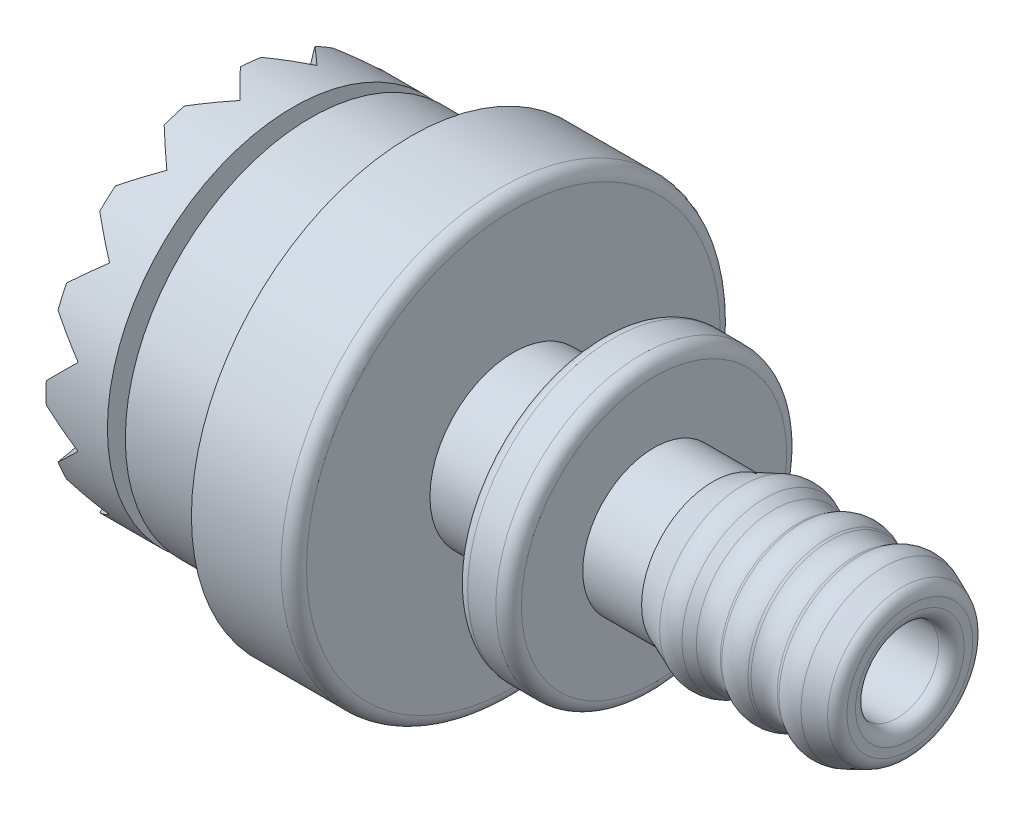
ISO-10303-21;
HEADER;
FILE_DESCRIPTION(('STEP AP214'),'2;1');
FILE_NAME('part.step','',(''),(''),'','','');
FILE_SCHEMA(('AUTOMOTIVE_DESIGN { 1 0 10303 214 1 1 1 1 }'));
ENDSEC;
DATA;
#1=APPLICATION_CONTEXT('core data for automotive mechanical design processes');
#2=APPLICATION_PROTOCOL_DEFINITION('international standard','automotive_design',2000,#1);
#3=PRODUCT_CONTEXT('',#1,'mechanical');
#4=PRODUCT('Part','Part','',(#3));
#5=PRODUCT_RELATED_PRODUCT_CATEGORY('part','',(#4));
#6=PRODUCT_DEFINITION_FORMATION('','',#4);
#7=PRODUCT_DEFINITION_CONTEXT('part definition',#1,'design');
#8=PRODUCT_DEFINITION('design','',#6,#7);
#9=PRODUCT_DEFINITION_SHAPE('','',#8);
#10=(LENGTH_UNIT() NAMED_UNIT(*) SI_UNIT(.MILLI.,.METRE.));
#11=(NAMED_UNIT(*) PLANE_ANGLE_UNIT() SI_UNIT($,.RADIAN.));
#12=(NAMED_UNIT(*) SI_UNIT($,.STERADIAN.) SOLID_ANGLE_UNIT());
#13=UNCERTAINTY_MEASURE_WITH_UNIT(LENGTH_MEASURE(1.E-05),#10,'distance_accuracy_value','');
#14=(GEOMETRIC_REPRESENTATION_CONTEXT(3) GLOBAL_UNCERTAINTY_ASSIGNED_CONTEXT((#13)) GLOBAL_UNIT_ASSIGNED_CONTEXT((#10,
#11,#12)) REPRESENTATION_CONTEXT('',''));
#15=CARTESIAN_POINT('',(0.,0.,0.));
#16=DIRECTION('',(0.,0.,1.));
#17=DIRECTION('',(1.,0.,0.));
#18=AXIS2_PLACEMENT_3D('',#15,#16,#17);
#19=CARTESIAN_POINT('',(0.,7.25,0.));
#20=DIRECTION('',(1.,0.,0.));
#21=DIRECTION('',(0.,0.,-1.));
#22=AXIS2_PLACEMENT_3D('',#19,#20,#21);
#23=PLANE('',#22);
#24=CARTESIAN_POINT('',(0.,0.,0.));
#25=DIRECTION('',(-1.,0.,0.));
#26=DIRECTION('',(0.,0.,1.));
#27=AXIS2_PLACEMENT_3D('',#24,#25,#26);
#28=CIRCLE('',#27,7.25);
#29=CARTESIAN_POINT('',(0.,-1.1,-7.16606586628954));
#30=VERTEX_POINT('',#29);
#31=CARTESIAN_POINT('',(0.,-1.90980157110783,-6.99393722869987));
#32=VERTEX_POINT('',#31);
#33=EDGE_CURVE('E516',#30,#32,#28,.T.);
#34=ORIENTED_EDGE('',*,*,#33,.T.);
#35=DIRECTION('',(0.,0.406736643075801,0.913545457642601));
#36=VECTOR('',#35,1.);
#37=CARTESIAN_POINT('',(0.,-3.60530603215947,-10.8021025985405));
#38=LINE('',#37,#36);
#39=CARTESIAN_POINT('',(0.,-1.22845086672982,-5.46359849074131));
#40=VERTEX_POINT('',#39);
#41=EDGE_CURVE('E344',#32,#40,#38,.T.);
#42=ORIENTED_EDGE('',*,*,#41,.T.);
#43=CARTESIAN_POINT('',(0.,0.,0.));
#44=DIRECTION('',(-1.,0.,0.));
#45=DIRECTION('',(0.,0.,1.));
#46=AXIS2_PLACEMENT_3D('',#43,#44,#45);
#47=CIRCLE('',#46,5.6);
#48=CARTESIAN_POINT('',(0.,-1.1,-5.49090156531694));
#49=VERTEX_POINT('',#48);
#50=EDGE_CURVE('E512',#49,#40,#47,.T.);
#51=ORIENTED_EDGE('',*,*,#50,.F.);
#52=DIRECTION('',(0.,0.,1.));
#53=VECTOR('',#52,1.);
#54=CARTESIAN_POINT('',(0.,-1.1,-8.585));
#55=LINE('',#54,#53);
#56=EDGE_CURVE('E429',#30,#49,#55,.T.);
#57=ORIENTED_EDGE('',*,*,#56,.F.);
#58=EDGE_LOOP('',(#34,#42,#51,#57));
#59=FACE_BOUND('',#58,.T.);
#60=ADVANCED_FACE('F34',(#59),#23,.F.);
#61=CARTESIAN_POINT('',(0.,-3.23825087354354,-4.56877787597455));
#62=VERTEX_POINT('',#61);
#63=CARTESIAN_POINT('',(0.,-3.34449141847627,-4.49158960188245));
#64=VERTEX_POINT('',#63);
#65=EDGE_CURVE('E515',#62,#64,#47,.T.);
#66=ORIENTED_EDGE('',*,*,#65,.F.);
#67=DIRECTION('',(0.,0.406736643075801,0.913545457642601));
#68=VECTOR('',#67,1.);
#69=CARTESIAN_POINT('',(0.,-5.61510603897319,-9.90728198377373));
#70=LINE('',#69,#68);
#71=CARTESIAN_POINT('',(0.,-3.91960157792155,-6.09911661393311));
#72=VERTEX_POINT('',#71);
#73=EDGE_CURVE('E350',#72,#62,#70,.T.);
#74=ORIENTED_EDGE('',*,*,#73,.F.);
#75=CARTESIAN_POINT('',(0.,-4.58938110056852,-5.61249330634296));
#76=VERTEX_POINT('',#75);
#77=EDGE_CURVE('E520',#72,#76,#28,.T.);
#78=ORIENTED_EDGE('',*,*,#77,.T.);
#79=DIRECTION('',(0.,0.743144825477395,0.669130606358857));
#80=VECTOR('',#79,1.);
#81=CARTESIAN_POINT('',(0.,-8.27412999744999,-8.93025611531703));
#82=LINE('',#81,#80);
#83=EDGE_CURVE('E643',#76,#64,#82,.T.);
#84=ORIENTED_EDGE('',*,*,#83,.T.);
#85=EDGE_LOOP('',(#66,#74,#78,#84));
#86=FACE_BOUND('',#85,.T.);
#87=ADVANCED_FACE('F640',(#86),#23,.F.);
#88=CARTESIAN_POINT('',(0.,-4.81657875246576,-2.85667098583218));
#89=VERTEX_POINT('',#88);
#90=CARTESIAN_POINT('',(0.,-4.8822390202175,-2.74294406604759));
#91=VERTEX_POINT('',#90);
#92=EDGE_CURVE('E644',#89,#91,#47,.T.);
#93=ORIENTED_EDGE('',*,*,#92,.F.);
#94=DIRECTION('',(0.,0.743144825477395,0.669130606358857));
#95=VECTOR('',#94,1.);
#96=CARTESIAN_POINT('',(0.,-9.74621733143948,-7.29533749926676));
#97=LINE('',#96,#95);
#98=CARTESIAN_POINT('',(0.,-6.061468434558,-3.97757469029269));
#99=VERTEX_POINT('',#98);
#100=EDGE_CURVE('E763',#99,#89,#97,.T.);
#101=ORIENTED_EDGE('',*,*,#100,.F.);
#102=CARTESIAN_POINT('',(0.,-6.47541494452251,-3.26059830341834));
#103=VERTEX_POINT('',#102);
#104=EDGE_CURVE('E746',#99,#103,#28,.T.);
#105=ORIENTED_EDGE('',*,*,#104,.T.);
#106=DIRECTION('',(0.,0.951056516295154,0.309016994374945));
#107=VECTOR('',#106,1.);
#108=CARTESIAN_POINT('',(0.,-9.94835495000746,-4.38902491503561));
#109=LINE('',#108,#107);
#110=EDGE_CURVE('E766',#103,#91,#109,.T.);
#111=ORIENTED_EDGE('',*,*,#110,.T.);
#112=EDGE_LOOP('',(#93,#101,#105,#111));
#113=FACE_BOUND('',#112,.T.);
#114=ADVANCED_FACE('F785',(#113),#23,.F.);
#115=CARTESIAN_POINT('',(0.,-5.56207640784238,-0.650619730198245));
#116=VERTEX_POINT('',#115);
#117=CARTESIAN_POINT('',(0.,-5.57580314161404,-0.520018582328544));
#118=VERTEX_POINT('',#117);
#119=EDGE_CURVE('E646',#116,#118,#47,.T.);
#120=ORIENTED_EDGE('',*,*,#119,.F.);
#121=DIRECTION('',(0.,0.951056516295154,0.309016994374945));
#122=VECTOR('',#121,1.);
#123=CARTESIAN_POINT('',(0.,-10.6281923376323,-2.29670057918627));
#124=LINE('',#123,#122);
#125=CARTESIAN_POINT('',(0.,-7.15525233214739,-1.168273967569));
#126=VERTEX_POINT('',#125);
#127=EDGE_CURVE('E870',#126,#116,#124,.T.);
#128=ORIENTED_EDGE('',*,*,#127,.F.);
#129=CARTESIAN_POINT('',(0.,-7.24179071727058,-0.344916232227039));
#130=VERTEX_POINT('',#129);
#131=EDGE_CURVE('E740',#126,#130,#28,.T.);
#132=ORIENTED_EDGE('',*,*,#131,.T.);
#133=DIRECTION('',(0.,0.994521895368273,-0.104528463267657));
#134=VECTOR('',#133,1.);
#135=CARTESIAN_POINT('',(0.,-9.49864081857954,-0.107711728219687));
#136=LINE('',#135,#134);
#137=EDGE_CURVE('E868',#130,#118,#136,.T.);
#138=ORIENTED_EDGE('',*,*,#137,.T.);
#139=EDGE_LOOP('',(#120,#128,#132,#138));
#140=FACE_BOUND('',#139,.T.);
#141=ADVANCED_FACE('F881',(#140),#23,.F.);
#142=CARTESIAN_POINT('',(0.,-5.34584052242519,1.66792958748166));
#143=VERTEX_POINT('',#142);
#144=CARTESIAN_POINT('',(0.,-5.3052602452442,1.79282283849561));
#145=VERTEX_POINT('',#144);
#146=EDGE_CURVE('E649',#143,#145,#47,.T.);
#147=ORIENTED_EDGE('',*,*,#146,.F.);
#148=DIRECTION('',(0.,0.994521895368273,-0.104528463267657));
#149=VECTOR('',#148,1.);
#150=CARTESIAN_POINT('',(0.,-9.2686781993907,2.08023644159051));
#151=LINE('',#150,#149);
#152=CARTESIAN_POINT('',(0.,-7.01182809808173,1.84303193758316));
#153=VERTEX_POINT('',#152);
#154=EDGE_CURVE('E863',#153,#143,#151,.T.);
#155=ORIENTED_EDGE('',*,*,#154,.F.);
#156=CARTESIAN_POINT('',(0.,-6.75599508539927,2.63040498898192));
#157=VERTEX_POINT('',#156);
#158=EDGE_CURVE('E734',#153,#157,#28,.T.);
#159=ORIENTED_EDGE('',*,*,#158,.T.);
#160=DIRECTION('',(0.,0.866025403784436,-0.500000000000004));
#161=VECTOR('',#160,1.);
#162=CARTESIAN_POINT('',(0.,-10.7061640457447,4.91103610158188));
#163=LINE('',#162,#161);
#164=EDGE_CURVE('E861',#157,#145,#163,.T.);
#165=ORIENTED_EDGE('',*,*,#164,.T.);
#166=EDGE_LOOP('',(#147,#155,#159,#165));
#167=FACE_BOUND('',#166,.T.);
#168=ADVANCED_FACE('F887',(#167),#23,.F.);
#169=CARTESIAN_POINT('',(0.,-4.20526024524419,3.69807872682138));
#170=VERTEX_POINT('',#169);
#171=CARTESIAN_POINT('',(0.,-4.11738965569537,3.79566890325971));
#172=VERTEX_POINT('',#171);
#173=EDGE_CURVE('E652',#170,#172,#47,.T.);
#174=ORIENTED_EDGE('',*,*,#173,.F.);
#175=DIRECTION('',(0.,0.866025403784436,-0.500000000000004));
#176=VECTOR('',#175,1.);
#177=CARTESIAN_POINT('',(0.,-9.60616404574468,6.81629198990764));
#178=LINE('',#177,#176);
#179=CARTESIAN_POINT('',(0.,-5.65599508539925,4.53566087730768));
#180=VERTEX_POINT('',#179);
#181=EDGE_CURVE('E856',#180,#170,#178,.T.);
#182=ORIENTED_EDGE('',*,*,#181,.F.);
#183=CARTESIAN_POINT('',(0.,-5.10202652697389,5.15090529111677));
#184=VERTEX_POINT('',#183);
#185=EDGE_CURVE('E728',#180,#184,#28,.T.);
#186=ORIENTED_EDGE('',*,*,#185,.T.);
#187=DIRECTION('',(0.,0.587785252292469,-0.80901699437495));
#188=VECTOR('',#187,1.);
#189=CARTESIAN_POINT('',(0.,-7.93837334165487,9.05480176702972));
#190=LINE('',#189,#188);
#191=EDGE_CURVE('E854',#184,#172,#190,.T.);
#192=ORIENTED_EDGE('',*,*,#191,.T.);
#193=EDGE_LOOP('',(#174,#182,#186,#192));
#194=FACE_BOUND('',#193,.T.);
#195=ADVANCED_FACE('F893',(#194),#23,.F.);
#196=CARTESIAN_POINT('',(0.,-2.33755226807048,5.08879645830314));
#197=VERTEX_POINT('',#196);
#198=CARTESIAN_POINT('',(0.,-2.21758498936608,5.14220933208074));
#199=VERTEX_POINT('',#198);
#200=EDGE_CURVE('E655',#197,#199,#47,.T.);
#201=ORIENTED_EDGE('',*,*,#200,.F.);
#202=DIRECTION('',(0.,0.587785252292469,-0.80901699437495));
#203=VECTOR('',#202,1.);
#204=CARTESIAN_POINT('',(0.,-6.15853595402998,10.3479293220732));
#205=LINE('',#204,#203);
#206=CARTESIAN_POINT('',(0.,-3.322189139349,6.4440328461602));
#207=VERTEX_POINT('',#206);
#208=EDGE_CURVE('E849',#207,#197,#205,.T.);
#209=ORIENTED_EDGE('',*,*,#208,.F.);
#210=CARTESIAN_POINT('',(0.,-2.56587123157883,6.78076727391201));
#211=VERTEX_POINT('',#210);
#212=EDGE_CURVE('E722',#207,#211,#28,.T.);
#213=ORIENTED_EDGE('',*,*,#212,.T.);
#214=DIRECTION('',(0.,0.207911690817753,-0.978147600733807));
#215=VECTOR('',#214,1.);
#216=CARTESIAN_POINT('',(0.,-3.19298552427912,9.73110805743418));
#217=LINE('',#216,#215);
#218=EDGE_CURVE('E847',#211,#199,#217,.T.);
#219=ORIENTED_EDGE('',*,*,#218,.T.);
#220=EDGE_LOOP('',(#201,#209,#213,#219));
#221=FACE_BOUND('',#220,.T.);
#222=ADVANCED_FACE('F899',(#221),#23,.F.);
#223=CARTESIAN_POINT('',(0.,-0.0656602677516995,5.5996150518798));
#224=VERTEX_POINT('',#223);
#225=CARTESIAN_POINT('',(0.,0.065660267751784,5.59961505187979));
#226=VERTEX_POINT('',#225);
#227=EDGE_CURVE('E658',#224,#226,#47,.T.);
#228=ORIENTED_EDGE('',*,*,#227,.F.);
#229=DIRECTION('',(0.,0.207911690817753,-0.978147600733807));
#230=VECTOR('',#229,1.);
#231=CARTESIAN_POINT('',(0.,-1.04106080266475,10.1885137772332));
#232=LINE('',#231,#230);
#233=CARTESIAN_POINT('',(0.,-0.413946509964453,7.23817299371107));
#234=VERTEX_POINT('',#233);
#235=EDGE_CURVE('E842',#234,#224,#232,.T.);
#236=ORIENTED_EDGE('',*,*,#235,.F.);
#237=CARTESIAN_POINT('',(0.,0.41394650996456,7.23817299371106));
#238=VERTEX_POINT('',#237);
#239=EDGE_CURVE('E716',#234,#238,#28,.T.);
#240=ORIENTED_EDGE('',*,*,#239,.T.);
#241=DIRECTION('',(0.,-0.207911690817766,-0.978147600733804));
#242=VECTOR('',#241,1.);
#243=CARTESIAN_POINT('',(0.,1.04106080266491,10.1885137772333));
#244=LINE('',#243,#242);
#245=EDGE_CURVE('E840',#238,#226,#244,.T.);
#246=ORIENTED_EDGE('',*,*,#245,.T.);
#247=EDGE_LOOP('',(#228,#236,#240,#246));
#248=FACE_BOUND('',#247,.T.);
#249=ADVANCED_FACE('F905',(#248),#23,.F.);
#250=CARTESIAN_POINT('',(0.,2.21758498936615,5.14220933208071));
#251=VERTEX_POINT('',#250);
#252=CARTESIAN_POINT('',(0.,2.33755226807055,5.0887964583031));
#253=VERTEX_POINT('',#252);
#254=EDGE_CURVE('E661',#251,#253,#47,.T.);
#255=ORIENTED_EDGE('',*,*,#254,.F.);
#256=DIRECTION('',(0.,-0.207911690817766,-0.978147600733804));
#257=VECTOR('',#256,1.);
#258=CARTESIAN_POINT('',(0.,3.19298552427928,9.73110805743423));
#259=LINE('',#258,#257);
#260=CARTESIAN_POINT('',(0.,2.56587123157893,6.78076727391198));
#261=VERTEX_POINT('',#260);
#262=EDGE_CURVE('E835',#261,#251,#259,.T.);
#263=ORIENTED_EDGE('',*,*,#262,.F.);
#264=CARTESIAN_POINT('',(0.,3.32218913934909,6.44403284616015));
#265=VERTEX_POINT('',#264);
#266=EDGE_CURVE('E710',#261,#265,#28,.T.);
#267=ORIENTED_EDGE('',*,*,#266,.T.);
#268=DIRECTION('',(0.,-0.58778525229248,-0.809016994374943));
#269=VECTOR('',#268,1.);
#270=CARTESIAN_POINT('',(0.,6.15853595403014,10.3479293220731));
#271=LINE('',#270,#269);
#272=EDGE_CURVE('E833',#265,#253,#271,.T.);
#273=ORIENTED_EDGE('',*,*,#272,.T.);
#274=EDGE_LOOP('',(#255,#263,#267,#273));
#275=FACE_BOUND('',#274,.T.);
#276=ADVANCED_FACE('F911',(#275),#23,.F.);
#277=CARTESIAN_POINT('',(0.,4.11738965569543,3.79566890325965));
#278=VERTEX_POINT('',#277);
#279=CARTESIAN_POINT('',(0.,4.20526024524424,3.69807872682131));
#280=VERTEX_POINT('',#279);
#281=EDGE_CURVE('E664',#278,#280,#47,.T.);
#282=ORIENTED_EDGE('',*,*,#281,.F.);
#283=DIRECTION('',(0.,-0.58778525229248,-0.809016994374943));
#284=VECTOR('',#283,1.);
#285=CARTESIAN_POINT('',(0.,7.93837334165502,9.05480176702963));
#286=LINE('',#285,#284);
#287=CARTESIAN_POINT('',(0.,5.10202652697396,5.1509052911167));
#288=VERTEX_POINT('',#287);
#289=EDGE_CURVE('E828',#288,#278,#286,.T.);
#290=ORIENTED_EDGE('',*,*,#289,.F.);
#291=CARTESIAN_POINT('',(0.,5.65599508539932,4.53566087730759));
#292=VERTEX_POINT('',#291);
#293=EDGE_CURVE('E704',#288,#292,#28,.T.);
#294=ORIENTED_EDGE('',*,*,#293,.T.);
#295=DIRECTION('',(0.,-0.866025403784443,-0.499999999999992));
#296=VECTOR('',#295,1.);
#297=CARTESIAN_POINT('',(0.,9.60616404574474,6.81629198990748));
#298=LINE('',#297,#296);
#299=EDGE_CURVE('E826',#292,#280,#298,.T.);
#300=ORIENTED_EDGE('',*,*,#299,.T.);
#301=EDGE_LOOP('',(#282,#290,#294,#300));
#302=FACE_BOUND('',#301,.T.);
#303=ADVANCED_FACE('F917',(#302),#23,.F.);
#304=CARTESIAN_POINT('',(0.,5.30526024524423,1.79282283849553));
#305=VERTEX_POINT('',#304);
#306=CARTESIAN_POINT('',(0.,5.34584052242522,1.66792958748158));
#307=VERTEX_POINT('',#306);
#308=EDGE_CURVE('E667',#305,#307,#47,.T.);
#309=ORIENTED_EDGE('',*,*,#308,.F.);
#310=DIRECTION('',(0.,-0.866025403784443,-0.499999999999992));
#311=VECTOR('',#310,1.);
#312=CARTESIAN_POINT('',(0.,10.7061640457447,4.9110361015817));
#313=LINE('',#312,#311);
#314=CARTESIAN_POINT('',(0.,6.7559950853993,2.63040498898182));
#315=VERTEX_POINT('',#314);
#316=EDGE_CURVE('E821',#315,#305,#313,.T.);
#317=ORIENTED_EDGE('',*,*,#316,.F.);
#318=CARTESIAN_POINT('',(0.,7.01182809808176,1.84303193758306));
#319=VERTEX_POINT('',#318);
#320=EDGE_CURVE('E698',#315,#319,#28,.T.);
#321=ORIENTED_EDGE('',*,*,#320,.T.);
#322=DIRECTION('',(0.,-0.994521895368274,-0.104528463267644));
#323=VECTOR('',#322,1.);
#324=CARTESIAN_POINT('',(0.,9.26867819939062,2.08023644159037));
#325=LINE('',#324,#323);
#326=EDGE_CURVE('E819',#319,#307,#325,.T.);
#327=ORIENTED_EDGE('',*,*,#326,.T.);
#328=EDGE_LOOP('',(#309,#317,#321,#327));
#329=FACE_BOUND('',#328,.T.);
#330=ADVANCED_FACE('F923',(#329),#23,.F.);
#331=CARTESIAN_POINT('',(0.,5.57580314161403,-0.520018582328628));
#332=VERTEX_POINT('',#331);
#333=CARTESIAN_POINT('',(0.,5.56207640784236,-0.650619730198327));
#334=VERTEX_POINT('',#333);
#335=EDGE_CURVE('E670',#332,#334,#47,.T.);
#336=ORIENTED_EDGE('',*,*,#335,.F.);
#337=DIRECTION('',(0.,-0.994521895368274,-0.104528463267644));
#338=VECTOR('',#337,1.);
#339=CARTESIAN_POINT('',(0.,9.49864081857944,-0.107711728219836));
#340=LINE('',#339,#338);
#341=CARTESIAN_POINT('',(0.,7.24179071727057,-0.344916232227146));
#342=VERTEX_POINT('',#341);
#343=EDGE_CURVE('E814',#342,#332,#340,.T.);
#344=ORIENTED_EDGE('',*,*,#343,.F.);
#345=CARTESIAN_POINT('',(0.,7.15525233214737,-1.16827396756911));
#346=VERTEX_POINT('',#345);
#347=EDGE_CURVE('E692',#342,#346,#28,.T.);
#348=ORIENTED_EDGE('',*,*,#347,.T.);
#349=DIRECTION('',(0.,-0.95105651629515,0.309016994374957));
#350=VECTOR('',#349,1.);
#351=CARTESIAN_POINT('',(0.,10.6281923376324,-2.29670057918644));
#352=LINE('',#351,#350);
#353=EDGE_CURVE('E812',#346,#334,#352,.T.);
#354=ORIENTED_EDGE('',*,*,#353,.T.);
#355=EDGE_LOOP('',(#336,#344,#348,#354));
#356=FACE_BOUND('',#355,.T.);
#357=ADVANCED_FACE('F801',(#356),#23,.F.);
#358=CARTESIAN_POINT('',(0.,4.88223902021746,-2.74294406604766));
#359=VERTEX_POINT('',#358);
#360=CARTESIAN_POINT('',(0.,4.81657875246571,-2.85667098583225));
#361=VERTEX_POINT('',#360);
#362=EDGE_CURVE('E673',#359,#361,#47,.T.);
#363=ORIENTED_EDGE('',*,*,#362,.F.);
#364=DIRECTION('',(0.,-0.95105651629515,0.309016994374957));
#365=VECTOR('',#364,1.);
#366=CARTESIAN_POINT('',(0.,9.94835495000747,-4.38902491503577));
#367=LINE('',#366,#365);
#368=CARTESIAN_POINT('',(0.,6.47541494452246,-3.26059830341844));
#369=VERTEX_POINT('',#368);
#370=EDGE_CURVE('E809',#369,#359,#367,.T.);
#371=ORIENTED_EDGE('',*,*,#370,.F.);
#372=CARTESIAN_POINT('',(0.,6.06146843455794,-3.97757469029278));
#373=VERTEX_POINT('',#372);
#374=EDGE_CURVE('E689',#369,#373,#28,.T.);
#375=ORIENTED_EDGE('',*,*,#374,.T.);
#376=DIRECTION('',(0.,-0.743144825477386,0.669130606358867));
#377=VECTOR('',#376,1.);
#378=CARTESIAN_POINT('',(0.,9.74621733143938,-7.2953374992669));
#379=LINE('',#378,#377);
#380=EDGE_CURVE('E807',#373,#361,#379,.T.);
#381=ORIENTED_EDGE('',*,*,#380,.T.);
#382=EDGE_LOOP('',(#363,#371,#375,#381));
#383=FACE_BOUND('',#382,.T.);
#384=ADVANCED_FACE('F797',(#383),#23,.F.);
#385=CARTESIAN_POINT('',(0.,3.3444914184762,-4.4915896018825));
#386=VERTEX_POINT('',#385);
#387=CARTESIAN_POINT('',(0.,3.23825087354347,-4.5687778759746));
#388=VERTEX_POINT('',#387);
#389=EDGE_CURVE('E676',#386,#388,#47,.T.);
#390=ORIENTED_EDGE('',*,*,#389,.F.);
#391=DIRECTION('',(0.,-0.743144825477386,0.669130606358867));
#392=VECTOR('',#391,1.);
#393=CARTESIAN_POINT('',(0.,8.27412999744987,-8.93025611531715));
#394=LINE('',#393,#392);
#395=CARTESIAN_POINT('',(0.,4.58938110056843,-5.61249330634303));
#396=VERTEX_POINT('',#395);
#397=EDGE_CURVE('E57',#396,#386,#394,.T.);
#398=ORIENTED_EDGE('',*,*,#397,.F.);
#399=CARTESIAN_POINT('',(0.,3.91960157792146,-6.09911661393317));
#400=VERTEX_POINT('',#399);
#401=EDGE_CURVE('E688',#396,#400,#28,.T.);
#402=ORIENTED_EDGE('',*,*,#401,.T.);
#403=DIRECTION('',(0.,-0.406736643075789,0.913545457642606));
#404=VECTOR('',#403,1.);
#405=CARTESIAN_POINT('',(0.,5.61510603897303,-9.90728198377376));
#406=LINE('',#405,#404);
#407=EDGE_CURVE('E327',#400,#388,#406,.T.);
#408=ORIENTED_EDGE('',*,*,#407,.T.);
#409=EDGE_LOOP('',(#390,#398,#402,#408));
#410=FACE_BOUND('',#409,.T.);
#411=ADVANCED_FACE('F789',(#410),#23,.F.);
#412=CARTESIAN_POINT('',(0.,0.,0.));
#413=DIRECTION('',(-1.,0.,0.));
#414=DIRECTION('',(0.,0.,1.));
#415=AXIS2_PLACEMENT_3D('',#412,#413,#414);
#416=CYLINDRICAL_SURFACE('',#415,7.25);
#417=CARTESIAN_POINT('',(1.1,0.,0.));
#418=DIRECTION('',(0.707106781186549,-0.645974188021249,0.287606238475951));
#419=DIRECTION('',(-0.707106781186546,-0.645974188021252,0.287606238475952));
#420=AXIS2_PLACEMENT_3D('',#417,#418,#419);
#421=ELLIPSE('',#420,10.2530483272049,7.25);
#422=CARTESIAN_POINT('',(1.1,-2.94884066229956,-6.62320456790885));
#423=VERTEX_POINT('',#422);
#424=EDGE_CURVE('E424',#72,#423,#421,.T.);
#425=ORIENTED_EDGE('',*,*,#424,.T.);
#426=CARTESIAN_POINT('',(1.1,0.,0.));
#427=DIRECTION('',(0.707106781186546,0.645974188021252,-0.287606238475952));
#428=DIRECTION('',(-0.707106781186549,0.64597418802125,-0.287606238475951));
#429=AXIS2_PLACEMENT_3D('',#426,#427,#428);
#430=ELLIPSE('',#429,10.253048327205,7.25);
#431=EDGE_CURVE('E426',#423,#32,#430,.T.);
#432=ORIENTED_EDGE('',*,*,#431,.T.);
#433=ORIENTED_EDGE('',*,*,#33,.F.);
#434=CARTESIAN_POINT('',(1.1,0.,0.));
#435=DIRECTION('',(0.707106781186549,-0.707106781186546,0.));
#436=DIRECTION('',(-0.707106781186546,-0.707106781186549,0.));
#437=AXIS2_PLACEMENT_3D('',#434,#435,#436);
#438=ELLIPSE('',#437,10.2530483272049,7.25);
#439=CARTESIAN_POINT('',(1.1,0.,-7.25));
#440=VERTEX_POINT('',#439);
#441=EDGE_CURVE('E433',#30,#440,#438,.T.);
#442=ORIENTED_EDGE('',*,*,#441,.T.);
#443=CARTESIAN_POINT('',(1.1,0.,0.));
#444=DIRECTION('',(0.707106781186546,0.707106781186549,0.));
#445=DIRECTION('',(-0.707106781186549,0.707106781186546,0.));
#446=AXIS2_PLACEMENT_3D('',#443,#444,#445);
#447=ELLIPSE('',#446,10.253048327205,7.25);
#448=CARTESIAN_POINT('',(0.,1.1,-7.16606586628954));
#449=VERTEX_POINT('',#448);
#450=EDGE_CURVE('E440',#440,#449,#447,.T.);
#451=ORIENTED_EDGE('',*,*,#450,.T.);
#452=CARTESIAN_POINT('',(0.,1.90980157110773,-6.9939372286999));
#453=VERTEX_POINT('',#452);
#454=EDGE_CURVE('E343',#453,#449,#28,.T.);
#455=ORIENTED_EDGE('',*,*,#454,.F.);
#456=CARTESIAN_POINT('',(1.1,0.,0.));
#457=DIRECTION('',(0.707106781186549,-0.645974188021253,-0.287606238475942));
#458=DIRECTION('',(-0.707106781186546,-0.645974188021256,-0.287606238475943));
#459=AXIS2_PLACEMENT_3D('',#456,#457,#458);
#460=ELLIPSE('',#459,10.2530483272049,7.25);
#461=CARTESIAN_POINT('',(1.1,2.94884066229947,-6.62320456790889));
#462=VERTEX_POINT('',#461);
#463=EDGE_CURVE('E333',#453,#462,#460,.T.);
#464=ORIENTED_EDGE('',*,*,#463,.T.);
#465=CARTESIAN_POINT('',(1.1,0.,0.));
#466=DIRECTION('',(0.707106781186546,0.645974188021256,0.287606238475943));
#467=DIRECTION('',(-0.707106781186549,0.645974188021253,0.287606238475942));
#468=AXIS2_PLACEMENT_3D('',#465,#466,#467);
#469=ELLIPSE('',#468,10.253048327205,7.25);
#470=EDGE_CURVE('E321',#462,#400,#469,.T.);
#471=ORIENTED_EDGE('',*,*,#470,.T.);
#472=ORIENTED_EDGE('',*,*,#401,.F.);
#473=CARTESIAN_POINT('',(1.1,0.,0.));
#474=DIRECTION('',(0.707106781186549,-0.47314678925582,-0.525482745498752));
#475=DIRECTION('',(-0.707106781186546,-0.473146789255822,-0.525482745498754));
#476=AXIS2_PLACEMENT_3D('',#473,#474,#475);
#477=ELLIPSE('',#476,10.2530483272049,7.25);
#478=CARTESIAN_POINT('',(1.1,5.38779998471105,-4.85119689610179));
#479=VERTEX_POINT('',#478);
#480=EDGE_CURVE('E332',#396,#479,#477,.T.);
#481=ORIENTED_EDGE('',*,*,#480,.T.);
#482=CARTESIAN_POINT('',(1.1,0.,0.));
#483=DIRECTION('',(0.707106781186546,0.473146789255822,0.525482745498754));
#484=DIRECTION('',(-0.707106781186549,0.47314678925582,0.525482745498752));
#485=AXIS2_PLACEMENT_3D('',#482,#483,#484);
#486=ELLIPSE('',#485,10.253048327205,7.25);
#487=EDGE_CURVE('E355',#479,#373,#486,.T.);
#488=ORIENTED_EDGE('',*,*,#487,.T.);
#489=ORIENTED_EDGE('',*,*,#374,.F.);
#490=CARTESIAN_POINT('',(1.1,0.,0.));
#491=DIRECTION('',(0.707106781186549,-0.218508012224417,-0.672498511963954));
#492=DIRECTION('',(-0.707106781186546,-0.218508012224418,-0.672498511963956));
#493=AXIS2_PLACEMENT_3D('',#490,#491,#492);
#494=ELLIPSE('',#493,10.2530483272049,7.25);
#495=CARTESIAN_POINT('',(1.1,6.89515974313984,-2.24037320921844));
#496=VERTEX_POINT('',#495);
#497=EDGE_CURVE('E358',#369,#496,#494,.T.);
#498=ORIENTED_EDGE('',*,*,#497,.T.);
#499=CARTESIAN_POINT('',(1.1,0.,0.));
#500=DIRECTION('',(0.707106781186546,0.218508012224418,0.672498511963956));
#501=DIRECTION('',(-0.707106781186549,0.218508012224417,0.672498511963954));
#502=AXIS2_PLACEMENT_3D('',#499,#500,#501);
#503=ELLIPSE('',#502,10.253048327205,7.25);
#504=EDGE_CURVE('E361',#496,#346,#503,.T.);
#505=ORIENTED_EDGE('',*,*,#504,.T.);
#506=ORIENTED_EDGE('',*,*,#347,.F.);
#507=CARTESIAN_POINT('',(1.1,0.,0.));
#508=DIRECTION('',(0.707106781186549,0.0739127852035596,-0.703233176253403));
#509=DIRECTION('',(-0.707106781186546,0.0739127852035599,-0.703233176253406));
#510=AXIS2_PLACEMENT_3D('',#507,#508,#509);
#511=ELLIPSE('',#510,10.2530483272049,7.25);
#512=CARTESIAN_POINT('',(1.1,7.21028374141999,0.757831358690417));
#513=VERTEX_POINT('',#512);
#514=EDGE_CURVE('E364',#342,#513,#511,.T.);
#515=ORIENTED_EDGE('',*,*,#514,.T.);
#516=CARTESIAN_POINT('',(1.1,0.,0.));
#517=DIRECTION('',(0.707106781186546,-0.0739127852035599,0.703233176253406));
#518=DIRECTION('',(-0.707106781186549,-0.0739127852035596,0.703233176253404));
#519=AXIS2_PLACEMENT_3D('',#516,#517,#518);
#520=ELLIPSE('',#519,10.253048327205,7.25);
#521=EDGE_CURVE('E367',#513,#319,#520,.T.);
#522=ORIENTED_EDGE('',*,*,#521,.T.);
#523=ORIENTED_EDGE('',*,*,#320,.F.);
#524=CARTESIAN_POINT('',(1.1,0.,0.));
#525=DIRECTION('',(0.707106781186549,0.353553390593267,-0.612372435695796));
#526=DIRECTION('',(-0.707106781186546,0.353553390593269,-0.612372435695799));
#527=AXIS2_PLACEMENT_3D('',#524,#525,#526);
#528=ELLIPSE('',#527,10.2530483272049,7.25);
#529=CARTESIAN_POINT('',(1.1,6.27868417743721,3.62499999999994));
#530=VERTEX_POINT('',#529);
#531=EDGE_CURVE('E370',#315,#530,#528,.T.);
#532=ORIENTED_EDGE('',*,*,#531,.T.);
#533=CARTESIAN_POINT('',(1.1,0.,0.));
#534=DIRECTION('',(0.707106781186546,-0.353553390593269,0.612372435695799));
#535=DIRECTION('',(-0.707106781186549,-0.353553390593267,0.612372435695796));
#536=AXIS2_PLACEMENT_3D('',#533,#534,#535);
#537=ELLIPSE('',#536,10.253048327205,7.25);
#538=EDGE_CURVE('E373',#530,#292,#537,.T.);
#539=ORIENTED_EDGE('',*,*,#538,.T.);
#540=ORIENTED_EDGE('',*,*,#293,.F.);
#541=CARTESIAN_POINT('',(1.1,0.,0.));
#542=DIRECTION('',(0.707106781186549,0.57206140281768,-0.415626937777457));
#543=DIRECTION('',(-0.707106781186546,0.572061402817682,-0.415626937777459));
#544=AXIS2_PLACEMENT_3D('',#541,#542,#543);
#545=ELLIPSE('',#544,10.2530483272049,7.25);
#546=CARTESIAN_POINT('',(1.1,4.26144307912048,5.86537320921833));
#547=VERTEX_POINT('',#546);
#548=EDGE_CURVE('E376',#288,#547,#545,.T.);
#549=ORIENTED_EDGE('',*,*,#548,.T.);
#550=CARTESIAN_POINT('',(1.1,0.,0.));
#551=DIRECTION('',(0.707106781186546,-0.572061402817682,0.415626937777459));
#552=DIRECTION('',(-0.707106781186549,-0.57206140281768,0.415626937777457));
#553=AXIS2_PLACEMENT_3D('',#550,#551,#552);
#554=ELLIPSE('',#553,10.253048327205,7.25);
#555=EDGE_CURVE('E379',#547,#265,#554,.T.);
#556=ORIENTED_EDGE('',*,*,#555,.T.);
#557=ORIENTED_EDGE('',*,*,#266,.F.);
#558=CARTESIAN_POINT('',(1.1,0.,0.));
#559=DIRECTION('',(0.707106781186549,0.691654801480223,-0.147015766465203));
#560=DIRECTION('',(-0.707106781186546,0.691654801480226,-0.147015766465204));
#561=AXIS2_PLACEMENT_3D('',#558,#559,#560);
#562=ELLIPSE('',#561,10.2530483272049,7.25);
#563=CARTESIAN_POINT('',(1.1,1.50735975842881,7.09157010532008));
#564=VERTEX_POINT('',#563);
#565=EDGE_CURVE('E382',#261,#564,#562,.T.);
#566=ORIENTED_EDGE('',*,*,#565,.T.);
#567=CARTESIAN_POINT('',(1.1,0.,0.));
#568=DIRECTION('',(0.707106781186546,-0.691654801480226,0.147015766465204));
#569=DIRECTION('',(-0.707106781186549,-0.691654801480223,0.147015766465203));
#570=AXIS2_PLACEMENT_3D('',#567,#568,#569);
#571=ELLIPSE('',#570,10.253048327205,7.25);
#572=EDGE_CURVE('E385',#564,#238,#571,.T.);
#573=ORIENTED_EDGE('',*,*,#572,.T.);
#574=ORIENTED_EDGE('',*,*,#239,.F.);
#575=CARTESIAN_POINT('',(1.1,0.,0.));
#576=DIRECTION('',(0.707106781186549,0.691654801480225,0.147015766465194));
#577=DIRECTION('',(-0.707106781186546,0.691654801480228,0.147015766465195));
#578=AXIS2_PLACEMENT_3D('',#575,#576,#577);
#579=ELLIPSE('',#578,10.2530483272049,7.25);
#580=CARTESIAN_POINT('',(1.1,-1.50735975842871,7.0915701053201));
#581=VERTEX_POINT('',#580);
#582=EDGE_CURVE('E388',#234,#581,#579,.T.);
#583=ORIENTED_EDGE('',*,*,#582,.T.);
#584=CARTESIAN_POINT('',(1.1,0.,0.));
#585=DIRECTION('',(0.707106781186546,-0.691654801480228,-0.147015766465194));
#586=DIRECTION('',(-0.707106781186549,-0.691654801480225,-0.147015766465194));
#587=AXIS2_PLACEMENT_3D('',#584,#585,#586);
#588=ELLIPSE('',#587,10.253048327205,7.25);
#589=EDGE_CURVE('E391',#581,#211,#588,.T.);
#590=ORIENTED_EDGE('',*,*,#589,.T.);
#591=ORIENTED_EDGE('',*,*,#212,.F.);
#592=CARTESIAN_POINT('',(1.1,0.,0.));
#593=DIRECTION('',(0.707106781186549,0.572061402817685,0.41562693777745));
#594=DIRECTION('',(-0.707106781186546,0.572061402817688,0.415626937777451));
#595=AXIS2_PLACEMENT_3D('',#592,#593,#594);
#596=ELLIPSE('',#595,10.2530483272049,7.25);
#597=CARTESIAN_POINT('',(1.1,-4.2614430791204,5.86537320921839));
#598=VERTEX_POINT('',#597);
#599=EDGE_CURVE('E394',#207,#598,#596,.T.);
#600=ORIENTED_EDGE('',*,*,#599,.T.);
#601=CARTESIAN_POINT('',(1.1,0.,0.));
#602=DIRECTION('',(0.707106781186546,-0.572061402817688,-0.415626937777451));
#603=DIRECTION('',(-0.707106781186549,-0.572061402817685,-0.41562693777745));
#604=AXIS2_PLACEMENT_3D('',#601,#602,#603);
#605=ELLIPSE('',#604,10.253048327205,7.25);
#606=EDGE_CURVE('E397',#598,#184,#605,.T.);
#607=ORIENTED_EDGE('',*,*,#606,.T.);
#608=ORIENTED_EDGE('',*,*,#185,.F.);
#609=CARTESIAN_POINT('',(1.1,0.,0.));
#610=DIRECTION('',(0.707106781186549,0.353553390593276,0.612372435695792));
#611=DIRECTION('',(-0.707106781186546,0.353553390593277,0.612372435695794));
#612=AXIS2_PLACEMENT_3D('',#609,#610,#611);
#613=ELLIPSE('',#612,10.2530483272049,7.25);
#614=CARTESIAN_POINT('',(1.1,-6.27868417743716,3.62500000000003));
#615=VERTEX_POINT('',#614);
#616=EDGE_CURVE('E400',#180,#615,#613,.T.);
#617=ORIENTED_EDGE('',*,*,#616,.T.);
#618=CARTESIAN_POINT('',(1.1,0.,0.));
#619=DIRECTION('',(0.707106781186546,-0.353553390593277,-0.612372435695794));
#620=DIRECTION('',(-0.707106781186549,-0.353553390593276,-0.612372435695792));
#621=AXIS2_PLACEMENT_3D('',#618,#619,#620);
#622=ELLIPSE('',#621,10.253048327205,7.25);
#623=EDGE_CURVE('E403',#615,#157,#622,.T.);
#624=ORIENTED_EDGE('',*,*,#623,.T.);
#625=ORIENTED_EDGE('',*,*,#158,.F.);
#626=CARTESIAN_POINT('',(1.1,0.,0.));
#627=DIRECTION('',(0.707106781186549,0.0739127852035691,0.703233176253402));
#628=DIRECTION('',(-0.707106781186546,0.0739127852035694,0.703233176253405));
#629=AXIS2_PLACEMENT_3D('',#626,#627,#628);
#630=ELLIPSE('',#629,10.2530483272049,7.25);
#631=CARTESIAN_POINT('',(1.1,-7.21028374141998,0.757831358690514));
#632=VERTEX_POINT('',#631);
#633=EDGE_CURVE('E406',#153,#632,#630,.T.);
#634=ORIENTED_EDGE('',*,*,#633,.T.);
#635=CARTESIAN_POINT('',(1.1,0.,0.));
#636=DIRECTION('',(0.707106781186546,-0.0739127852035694,-0.703233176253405));
#637=DIRECTION('',(-0.707106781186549,-0.0739127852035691,-0.703233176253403));
#638=AXIS2_PLACEMENT_3D('',#635,#636,#637);
#639=ELLIPSE('',#638,10.253048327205,7.25);
#640=EDGE_CURVE('E409',#632,#130,#639,.T.);
#641=ORIENTED_EDGE('',*,*,#640,.T.);
#642=ORIENTED_EDGE('',*,*,#131,.F.);
#643=CARTESIAN_POINT('',(1.1,0.,0.));
#644=DIRECTION('',(0.707106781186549,-0.218508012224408,0.672498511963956));
#645=DIRECTION('',(-0.707106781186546,-0.218508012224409,0.672498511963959));
#646=AXIS2_PLACEMENT_3D('',#643,#644,#645);
#647=ELLIPSE('',#646,10.2530483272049,7.25);
#648=CARTESIAN_POINT('',(1.1,-6.89515974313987,-2.24037320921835));
#649=VERTEX_POINT('',#648);
#650=EDGE_CURVE('E412',#126,#649,#647,.T.);
#651=ORIENTED_EDGE('',*,*,#650,.T.);
#652=CARTESIAN_POINT('',(1.1,0.,0.));
#653=DIRECTION('',(0.707106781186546,0.218508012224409,-0.672498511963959));
#654=DIRECTION('',(-0.707106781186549,0.218508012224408,-0.672498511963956));
#655=AXIS2_PLACEMENT_3D('',#652,#653,#654);
#656=ELLIPSE('',#655,10.253048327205,7.25);
#657=EDGE_CURVE('E415',#649,#103,#656,.T.);
#658=ORIENTED_EDGE('',*,*,#657,.T.);
#659=ORIENTED_EDGE('',*,*,#104,.F.);
#660=CARTESIAN_POINT('',(1.1,0.,0.));
#661=DIRECTION('',(0.707106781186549,-0.473146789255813,0.525482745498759));
#662=DIRECTION('',(-0.707106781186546,-0.473146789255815,0.525482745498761));
#663=AXIS2_PLACEMENT_3D('',#660,#661,#662);
#664=ELLIPSE('',#663,10.2530483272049,7.25);
#665=CARTESIAN_POINT('',(1.1,-5.38779998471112,-4.85119689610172));
#666=VERTEX_POINT('',#665);
#667=EDGE_CURVE('E418',#99,#666,#664,.T.);
#668=ORIENTED_EDGE('',*,*,#667,.T.);
#669=CARTESIAN_POINT('',(1.1,0.,0.));
#670=DIRECTION('',(0.707106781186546,0.473146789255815,-0.525482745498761));
#671=DIRECTION('',(-0.707106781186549,0.473146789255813,-0.525482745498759));
#672=AXIS2_PLACEMENT_3D('',#669,#670,#671);
#673=ELLIPSE('',#672,10.253048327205,7.25);
#674=EDGE_CURVE('E421',#666,#76,#673,.T.);
#675=ORIENTED_EDGE('',*,*,#674,.T.);
#676=ORIENTED_EDGE('',*,*,#77,.F.);
#677=EDGE_LOOP('',(#425,#432,#433,#442,#451,#455,#464,#471,#472,#481,#488,#489,#498,#505,#506,
#515,#522,#523,#532,#539,#540,#549,#556,#557,#566,#573,#574,#583,#590,#591,#600,#607,#608,#617,
#624,#625,#634,#641,#642,#651,#658,#659,#668,#675,#676));
#678=FACE_BOUND('',#677,.T.);
#679=CARTESIAN_POINT('',(2.4,0.,0.));
#680=DIRECTION('',(-1.,0.,0.));
#681=DIRECTION('',(0.,0.,1.));
#682=AXIS2_PLACEMENT_3D('',#679,#680,#681);
#683=CIRCLE('',#682,7.25);
#684=CARTESIAN_POINT('',(2.4,0.,7.25));
#685=VERTEX_POINT('',#684);
#686=EDGE_CURVE('E442',#685,#685,#683,.T.);
#687=ORIENTED_EDGE('',*,*,#686,.T.);
#688=EDGE_LOOP('',(#687));
#689=FACE_BOUND('',#688,.T.);
#690=ADVANCED_FACE('F340',(#678,#689),#416,.T.);
#691=CARTESIAN_POINT('',(0.,1.22845086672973,-5.46359849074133));
#692=VERTEX_POINT('',#691);
#693=CARTESIAN_POINT('',(0.,1.1,-5.49090156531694));
#694=VERTEX_POINT('',#693);
#695=EDGE_CURVE('E511',#692,#694,#47,.T.);
#696=ORIENTED_EDGE('',*,*,#695,.F.);
#697=DIRECTION('',(0.,-0.406736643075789,0.913545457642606));
#698=VECTOR('',#697,1.);
#699=CARTESIAN_POINT('',(0.,3.60530603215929,-10.8021025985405));
#700=LINE('',#699,#698);
#701=EDGE_CURVE('E49',#453,#692,#700,.T.);
#702=ORIENTED_EDGE('',*,*,#701,.F.);
#703=ORIENTED_EDGE('',*,*,#454,.T.);
#704=DIRECTION('',(0.,0.,1.));
#705=VECTOR('',#704,1.);
#706=CARTESIAN_POINT('',(0.,1.1,-8.585));
#707=LINE('',#706,#705);
#708=EDGE_CURVE('E430',#449,#694,#707,.T.);
#709=ORIENTED_EDGE('',*,*,#708,.T.);
#710=EDGE_LOOP('',(#696,#702,#703,#709));
#711=FACE_BOUND('',#710,.T.);
#712=ADVANCED_FACE('F687',(#711),#23,.F.);
#713=CARTESIAN_POINT('',(0.,0.,0.));
#714=DIRECTION('',(-1.,0.,0.));
#715=DIRECTION('',(0.,0.,1.));
#716=AXIS2_PLACEMENT_3D('',#713,#714,#715);
#717=CONICAL_SURFACE('',#716,5.6,0.523598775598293);
#718=CARTESIAN_POINT('',(1.55884572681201,0.,0.));
#719=DIRECTION('',(-1.,0.,0.));
#720=DIRECTION('',(0.,0.,1.));
#721=AXIS2_PLACEMENT_3D('',#718,#719,#720);
#722=CIRCLE('',#721,4.7);
#723=CARTESIAN_POINT('',(1.55884572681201,0.,4.7));
#724=VERTEX_POINT('',#723);
#725=EDGE_CURVE('E508',#724,#724,#722,.T.);
#726=ORIENTED_EDGE('',*,*,#725,.F.);
#727=EDGE_LOOP('',(#726));
#728=FACE_BOUND('',#727,.T.);
#729=ORIENTED_EDGE('',*,*,#50,.T.);
#730=CARTESIAN_POINT('',(-3.19974226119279,3.92801001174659,-1.7488627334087));
#731=DIRECTION('',(0.707106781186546,0.645974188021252,-0.287606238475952));
#732=DIRECTION('',(-0.707106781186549,0.64597418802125,-0.287606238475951));
#733=AXIS2_PLACEMENT_3D('',#730,#731,#732);
#734=ELLIPSE('',#733,10.5321745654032,6.08075382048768);
#735=CARTESIAN_POINT('',(1.1,-2.01941273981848,-4.53567527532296));
#736=VERTEX_POINT('',#735);
#737=EDGE_CURVE('E11',#40,#736,#734,.F.);
#738=ORIENTED_EDGE('',*,*,#737,.T.);
#739=CARTESIAN_POINT('',(-3.19974226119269,-3.92801001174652,1.74886273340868));
#740=DIRECTION('',(0.707106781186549,-0.645974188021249,0.287606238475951));
#741=DIRECTION('',(-0.707106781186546,-0.645974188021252,0.287606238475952));
#742=AXIS2_PLACEMENT_3D('',#739,#740,#741);
#743=ELLIPSE('',#742,10.5321745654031,6.08075382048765);
#744=EDGE_CURVE('E42',#736,#62,#743,.F.);
#745=ORIENTED_EDGE('',*,*,#744,.T.);
#746=ORIENTED_EDGE('',*,*,#65,.T.);
#747=CARTESIAN_POINT('',(-3.19974226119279,2.87708914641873,-3.19533121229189));
#748=DIRECTION('',(0.707106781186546,0.473146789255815,-0.525482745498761));
#749=DIRECTION('',(-0.707106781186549,0.473146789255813,-0.525482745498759));
#750=AXIS2_PLACEMENT_3D('',#747,#748,#749);
#751=ELLIPSE('',#750,10.5321745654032,6.08075382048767);
#752=CARTESIAN_POINT('',(1.1,-3.68965067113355,-3.32217638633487));
#753=VERTEX_POINT('',#752);
#754=EDGE_CURVE('E627',#64,#753,#751,.F.);
#755=ORIENTED_EDGE('',*,*,#754,.T.);
#756=CARTESIAN_POINT('',(-3.19974226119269,-2.87708914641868,3.19533121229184));
#757=DIRECTION('',(0.707106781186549,-0.473146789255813,0.525482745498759));
#758=DIRECTION('',(-0.707106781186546,-0.473146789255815,0.525482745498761));
#759=AXIS2_PLACEMENT_3D('',#756,#757,#758);
#760=ELLIPSE('',#759,10.5321745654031,6.08075382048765);
#761=EDGE_CURVE('E624',#753,#89,#760,.F.);
#762=ORIENTED_EDGE('',*,*,#761,.T.);
#763=ORIENTED_EDGE('',*,*,#92,.T.);
#764=CARTESIAN_POINT('',(-3.19974226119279,1.32869343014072,-4.08929789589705));
#765=DIRECTION('',(0.707106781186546,0.218508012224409,-0.672498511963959));
#766=DIRECTION('',(-0.707106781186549,0.218508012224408,-0.672498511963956));
#767=AXIS2_PLACEMENT_3D('',#764,#765,#766);
#768=ELLIPSE('',#767,10.5321745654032,6.08075382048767);
#769=CARTESIAN_POINT('',(1.1,-4.72191448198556,-1.5342430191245));
#770=VERTEX_POINT('',#769);
#771=EDGE_CURVE('E621',#91,#770,#768,.F.);
#772=ORIENTED_EDGE('',*,*,#771,.T.);
#773=CARTESIAN_POINT('',(-3.19974226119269,-1.3286934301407,4.08929789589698));
#774=DIRECTION('',(0.707106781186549,-0.218508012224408,0.672498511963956));
#775=DIRECTION('',(-0.707106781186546,-0.218508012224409,0.672498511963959));
#776=AXIS2_PLACEMENT_3D('',#773,#774,#775);
#777=ELLIPSE('',#776,10.532174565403,6.08075382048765);
#778=EDGE_CURVE('E618',#770,#116,#777,.F.);
#779=ORIENTED_EDGE('',*,*,#778,.T.);
#780=ORIENTED_EDGE('',*,*,#119,.T.);
#781=CARTESIAN_POINT('',(-3.19974226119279,-0.449445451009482,-4.2761878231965));
#782=DIRECTION('',(0.707106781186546,-0.0739127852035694,-0.703233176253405));
#783=DIRECTION('',(-0.707106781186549,-0.0739127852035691,-0.703233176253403));
#784=AXIS2_PLACEMENT_3D('',#781,#782,#783);
#785=ELLIPSE('',#784,10.5321745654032,6.08075382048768);
#786=CARTESIAN_POINT('',(1.1,-4.9377163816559,0.518974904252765));
#787=VERTEX_POINT('',#786);
#788=EDGE_CURVE('E615',#118,#787,#785,.F.);
#789=ORIENTED_EDGE('',*,*,#788,.T.);
#790=CARTESIAN_POINT('',(-3.19974226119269,0.449445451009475,4.27618782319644));
#791=DIRECTION('',(0.707106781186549,0.0739127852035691,0.703233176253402));
#792=DIRECTION('',(-0.707106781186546,0.0739127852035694,0.703233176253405));
#793=AXIS2_PLACEMENT_3D('',#790,#791,#792);
#794=ELLIPSE('',#793,10.5321745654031,6.08075382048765);
#795=EDGE_CURVE('E612',#787,#143,#794,.F.);
#796=ORIENTED_EDGE('',*,*,#795,.T.);
#797=ORIENTED_EDGE('',*,*,#146,.T.);
#798=CARTESIAN_POINT('',(-3.19974226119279,-2.1498711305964,-3.72368602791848));
#799=DIRECTION('',(0.707106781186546,-0.353553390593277,-0.612372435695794));
#800=DIRECTION('',(-0.707106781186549,-0.353553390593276,-0.612372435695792));
#801=AXIS2_PLACEMENT_3D('',#798,#799,#800);
#802=ELLIPSE('',#801,10.5321745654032,6.08075382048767);
#803=CARTESIAN_POINT('',(1.1,-4.29974226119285,2.48245735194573));
#804=VERTEX_POINT('',#803);
#805=EDGE_CURVE('E609',#145,#804,#802,.F.);
#806=ORIENTED_EDGE('',*,*,#805,.T.);
#807=CARTESIAN_POINT('',(-3.19974226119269,2.14987113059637,3.72368602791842));
#808=DIRECTION('',(0.707106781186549,0.353553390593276,0.612372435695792));
#809=DIRECTION('',(-0.707106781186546,0.353553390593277,0.612372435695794));
#810=AXIS2_PLACEMENT_3D('',#807,#808,#809);
#811=ELLIPSE('',#810,10.5321745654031,6.08075382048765);
#812=EDGE_CURVE('E606',#804,#170,#811,.F.);
#813=ORIENTED_EDGE('',*,*,#812,.T.);
#814=ORIENTED_EDGE('',*,*,#173,.T.);
#815=CARTESIAN_POINT('',(-3.1997422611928,-3.47856456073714,-2.52732508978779));
#816=DIRECTION('',(0.707106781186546,-0.572061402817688,-0.415626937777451));
#817=DIRECTION('',(-0.707106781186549,-0.572061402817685,-0.41562693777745));
#818=AXIS2_PLACEMENT_3D('',#815,#816,#817);
#819=ELLIPSE('',#818,10.5321745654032,6.08075382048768);
#820=CARTESIAN_POINT('',(1.1,-2.91830364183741,4.01670037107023));
#821=VERTEX_POINT('',#820);
#822=EDGE_CURVE('E603',#172,#821,#819,.F.);
#823=ORIENTED_EDGE('',*,*,#822,.T.);
#824=CARTESIAN_POINT('',(-3.19974226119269,3.47856456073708,2.52732508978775));
#825=DIRECTION('',(0.707106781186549,0.572061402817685,0.41562693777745));
#826=DIRECTION('',(-0.707106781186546,0.572061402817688,0.415626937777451));
#827=AXIS2_PLACEMENT_3D('',#824,#825,#826);
#828=ELLIPSE('',#827,10.5321745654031,6.08075382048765);
#829=EDGE_CURVE('E600',#821,#197,#828,.F.);
#830=ORIENTED_EDGE('',*,*,#829,.T.);
#831=ORIENTED_EDGE('',*,*,#200,.T.);
#832=CARTESIAN_POINT('',(-3.1997422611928,-4.20578257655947,-0.89396668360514));
#833=DIRECTION('',(0.707106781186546,-0.691654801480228,-0.147015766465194));
#834=DIRECTION('',(-0.707106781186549,-0.691654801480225,-0.147015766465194));
#835=AXIS2_PLACEMENT_3D('',#832,#833,#834);
#836=ELLIPSE('',#835,10.5321745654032,6.08075382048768);
#837=CARTESIAN_POINT('',(1.1,-1.03226381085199,4.85641940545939));
#838=VERTEX_POINT('',#837);
#839=EDGE_CURVE('E597',#199,#838,#836,.F.);
#840=ORIENTED_EDGE('',*,*,#839,.T.);
#841=CARTESIAN_POINT('',(-3.19974226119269,4.2057825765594,0.893966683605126));
#842=DIRECTION('',(0.707106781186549,0.691654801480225,0.147015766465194));
#843=DIRECTION('',(-0.707106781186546,0.691654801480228,0.147015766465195));
#844=AXIS2_PLACEMENT_3D('',#841,#842,#843);
#845=ELLIPSE('',#844,10.5321745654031,6.08075382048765);
#846=EDGE_CURVE('E594',#838,#224,#845,.F.);
#847=ORIENTED_EDGE('',*,*,#846,.T.);
#848=ORIENTED_EDGE('',*,*,#227,.T.);
#849=CARTESIAN_POINT('',(-3.19974226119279,-4.20578257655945,0.893966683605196));
#850=DIRECTION('',(0.707106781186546,-0.691654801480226,0.147015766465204));
#851=DIRECTION('',(-0.707106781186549,-0.691654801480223,0.147015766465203));
#852=AXIS2_PLACEMENT_3D('',#849,#850,#851);
#853=ELLIPSE('',#852,10.5321745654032,6.08075382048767);
#854=CARTESIAN_POINT('',(1.1,1.03226381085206,4.85641940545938));
#855=VERTEX_POINT('',#854);
#856=EDGE_CURVE('E591',#226,#855,#853,.F.);
#857=ORIENTED_EDGE('',*,*,#856,.T.);
#858=CARTESIAN_POINT('',(-3.19974226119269,4.20578257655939,-0.893966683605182));
#859=DIRECTION('',(0.707106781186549,0.691654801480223,-0.147015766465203));
#860=DIRECTION('',(-0.707106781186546,0.691654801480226,-0.147015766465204));
#861=AXIS2_PLACEMENT_3D('',#858,#859,#860);
#862=ELLIPSE('',#861,10.5321745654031,6.08075382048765);
#863=EDGE_CURVE('E588',#855,#251,#862,.F.);
#864=ORIENTED_EDGE('',*,*,#863,.T.);
#865=ORIENTED_EDGE('',*,*,#254,.T.);
#866=CARTESIAN_POINT('',(-3.19974226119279,-3.4785645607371,2.52732508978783));
#867=DIRECTION('',(0.707106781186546,-0.572061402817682,0.415626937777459));
#868=DIRECTION('',(-0.707106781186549,-0.57206140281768,0.415626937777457));
#869=AXIS2_PLACEMENT_3D('',#866,#867,#868);
#870=ELLIPSE('',#869,10.5321745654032,6.08075382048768);
#871=CARTESIAN_POINT('',(1.1,2.91830364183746,4.0167003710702));
#872=VERTEX_POINT('',#871);
#873=EDGE_CURVE('E585',#253,#872,#870,.F.);
#874=ORIENTED_EDGE('',*,*,#873,.T.);
#875=CARTESIAN_POINT('',(-3.19974226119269,3.47856456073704,-2.52732508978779));
#876=DIRECTION('',(0.707106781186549,0.57206140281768,-0.415626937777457));
#877=DIRECTION('',(-0.707106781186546,0.572061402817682,-0.415626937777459));
#878=AXIS2_PLACEMENT_3D('',#875,#876,#877);
#879=ELLIPSE('',#878,10.5321745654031,6.08075382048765);
#880=EDGE_CURVE('E582',#872,#278,#879,.F.);
#881=ORIENTED_EDGE('',*,*,#880,.T.);
#882=ORIENTED_EDGE('',*,*,#281,.T.);
#883=CARTESIAN_POINT('',(-3.1997422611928,-2.14987113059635,3.72368602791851));
#884=DIRECTION('',(0.707106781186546,-0.353553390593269,0.612372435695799));
#885=DIRECTION('',(-0.707106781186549,-0.353553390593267,0.612372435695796));
#886=AXIS2_PLACEMENT_3D('',#883,#884,#885);
#887=ELLIPSE('',#886,10.5321745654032,6.08075382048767);
#888=CARTESIAN_POINT('',(1.1,4.29974226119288,2.48245735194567));
#889=VERTEX_POINT('',#888);
#890=EDGE_CURVE('E579',#280,#889,#887,.F.);
#891=ORIENTED_EDGE('',*,*,#890,.T.);
#892=CARTESIAN_POINT('',(-3.19974226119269,2.14987113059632,-3.72368602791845));
#893=DIRECTION('',(0.707106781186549,0.353553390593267,-0.612372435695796));
#894=DIRECTION('',(-0.707106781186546,0.353553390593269,-0.612372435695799));
#895=AXIS2_PLACEMENT_3D('',#892,#893,#894);
#896=ELLIPSE('',#895,10.5321745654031,6.08075382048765);
#897=EDGE_CURVE('E576',#889,#305,#896,.F.);
#898=ORIENTED_EDGE('',*,*,#897,.T.);
#899=ORIENTED_EDGE('',*,*,#308,.T.);
#900=CARTESIAN_POINT('',(-3.19974226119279,-0.449445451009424,4.27618782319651));
#901=DIRECTION('',(0.707106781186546,-0.0739127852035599,0.703233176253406));
#902=DIRECTION('',(-0.707106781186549,-0.0739127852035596,0.703233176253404));
#903=AXIS2_PLACEMENT_3D('',#900,#901,#902);
#904=ELLIPSE('',#903,10.5321745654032,6.08075382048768);
#905=CARTESIAN_POINT('',(1.1,4.93771638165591,0.518974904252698));
#906=VERTEX_POINT('',#905);
#907=EDGE_CURVE('E573',#307,#906,#904,.F.);
#908=ORIENTED_EDGE('',*,*,#907,.T.);
#909=CARTESIAN_POINT('',(-3.19974226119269,0.449445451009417,-4.27618782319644));
#910=DIRECTION('',(0.707106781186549,0.0739127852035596,-0.703233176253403));
#911=DIRECTION('',(-0.707106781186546,0.0739127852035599,-0.703233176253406));
#912=AXIS2_PLACEMENT_3D('',#909,#910,#911);
#913=ELLIPSE('',#912,10.5321745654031,6.08075382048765);
#914=EDGE_CURVE('E570',#906,#332,#913,.F.);
#915=ORIENTED_EDGE('',*,*,#914,.T.);
#916=ORIENTED_EDGE('',*,*,#335,.T.);
#917=CARTESIAN_POINT('',(-3.19974226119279,1.32869343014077,4.08929789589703));
#918=DIRECTION('',(0.707106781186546,0.218508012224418,0.672498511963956));
#919=DIRECTION('',(-0.707106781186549,0.218508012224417,0.672498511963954));
#920=AXIS2_PLACEMENT_3D('',#917,#918,#919);
#921=ELLIPSE('',#920,10.5321745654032,6.08075382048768);
#922=CARTESIAN_POINT('',(1.1,4.72191448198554,-1.53424301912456));
#923=VERTEX_POINT('',#922);
#924=EDGE_CURVE('E567',#334,#923,#921,.F.);
#925=ORIENTED_EDGE('',*,*,#924,.T.);
#926=CARTESIAN_POINT('',(-3.19974226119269,-1.32869343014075,-4.08929789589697));
#927=DIRECTION('',(0.707106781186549,-0.218508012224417,-0.672498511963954));
#928=DIRECTION('',(-0.707106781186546,-0.218508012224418,-0.672498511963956));
#929=AXIS2_PLACEMENT_3D('',#926,#927,#928);
#930=ELLIPSE('',#929,10.5321745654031,6.08075382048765);
#931=EDGE_CURVE('E564',#923,#359,#930,.F.);
#932=ORIENTED_EDGE('',*,*,#931,.T.);
#933=ORIENTED_EDGE('',*,*,#362,.T.);
#934=CARTESIAN_POINT('',(-3.1997422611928,2.87708914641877,3.19533121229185));
#935=DIRECTION('',(0.707106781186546,0.473146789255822,0.525482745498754));
#936=DIRECTION('',(-0.707106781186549,0.47314678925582,0.525482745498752));
#937=AXIS2_PLACEMENT_3D('',#934,#935,#936);
#938=ELLIPSE('',#937,10.5321745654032,6.08075382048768);
#939=CARTESIAN_POINT('',(1.1,3.6896506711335,-3.32217638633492));
#940=VERTEX_POINT('',#939);
#941=EDGE_CURVE('E561',#361,#940,#938,.F.);
#942=ORIENTED_EDGE('',*,*,#941,.T.);
#943=CARTESIAN_POINT('',(-3.19974226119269,-2.87708914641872,-3.1953312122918));
#944=DIRECTION('',(0.707106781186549,-0.47314678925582,-0.525482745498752));
#945=DIRECTION('',(-0.707106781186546,-0.473146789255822,-0.525482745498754));
#946=AXIS2_PLACEMENT_3D('',#943,#944,#945);
#947=ELLIPSE('',#946,10.5321745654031,6.08075382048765);
#948=EDGE_CURVE('E559',#940,#386,#947,.F.);
#949=ORIENTED_EDGE('',*,*,#948,.T.);
#950=ORIENTED_EDGE('',*,*,#389,.T.);
#951=CARTESIAN_POINT('',(-3.19974226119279,3.92801001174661,1.74886273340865));
#952=DIRECTION('',(0.707106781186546,0.645974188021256,0.287606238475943));
#953=DIRECTION('',(-0.707106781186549,0.645974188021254,0.287606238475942));
#954=AXIS2_PLACEMENT_3D('',#951,#952,#953);
#955=ELLIPSE('',#954,10.5321745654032,6.08075382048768);
#956=CARTESIAN_POINT('',(1.1,2.01941273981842,-4.53567527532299));
#957=VERTEX_POINT('',#956);
#958=EDGE_CURVE('E557',#388,#957,#955,.F.);
#959=ORIENTED_EDGE('',*,*,#958,.T.);
#960=CARTESIAN_POINT('',(-3.19974226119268,-3.92801001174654,-1.74886273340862));
#961=DIRECTION('',(0.707106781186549,-0.645974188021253,-0.287606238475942));
#962=DIRECTION('',(-0.707106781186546,-0.645974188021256,-0.287606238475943));
#963=AXIS2_PLACEMENT_3D('',#960,#961,#962);
#964=ELLIPSE('',#963,10.532174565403,6.08075382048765);
#965=EDGE_CURVE('E336',#957,#692,#964,.F.);
#966=ORIENTED_EDGE('',*,*,#965,.T.);
#967=ORIENTED_EDGE('',*,*,#695,.T.);
#968=CARTESIAN_POINT('',(-3.19974226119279,4.29974226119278,0.));
#969=DIRECTION('',(0.707106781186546,0.707106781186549,0.));
#970=DIRECTION('',(-0.707106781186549,0.707106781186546,0.));
#971=AXIS2_PLACEMENT_3D('',#968,#969,#970);
#972=ELLIPSE('',#971,10.5321745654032,6.08075382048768);
#973=CARTESIAN_POINT('',(1.1,0.,-4.96491470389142));
#974=VERTEX_POINT('',#973);
#975=EDGE_CURVE('E523',#694,#974,#972,.F.);
#976=ORIENTED_EDGE('',*,*,#975,.T.);
#977=CARTESIAN_POINT('',(-3.19974226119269,-4.29974226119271,0.));
#978=DIRECTION('',(0.707106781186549,-0.707106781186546,0.));
#979=DIRECTION('',(-0.707106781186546,-0.707106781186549,0.));
#980=AXIS2_PLACEMENT_3D('',#977,#978,#979);
#981=ELLIPSE('',#980,10.5321745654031,6.08075382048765);
#982=EDGE_CURVE('E519',#974,#49,#981,.F.);
#983=ORIENTED_EDGE('',*,*,#982,.T.);
#984=EDGE_LOOP('',(#729,#738,#745,#746,#755,#762,#763,#772,#779,#780,#789,#796,#797,#806,#813,
#814,#823,#830,#831,#840,#847,#848,#857,#864,#865,#874,#881,#882,#891,#898,#899,#908,#915,#916,
#925,#932,#933,#942,#949,#950,#959,#966,#967,#976,#983));
#985=FACE_BOUND('',#984,.T.);
#986=ADVANCED_FACE('F633',(#728,#985),#717,.F.);
#987=CARTESIAN_POINT('',(0.,0.,0.));
#988=DIRECTION('',(-1.,0.,0.));
#989=DIRECTION('',(0.,0.,1.));
#990=AXIS2_PLACEMENT_3D('',#987,#988,#989);
#991=CYLINDRICAL_SURFACE('',#990,4.7);
#992=CARTESIAN_POINT('',(6.5,0.,0.));
#993=DIRECTION('',(-1.,0.,0.));
#994=DIRECTION('',(0.,0.,1.));
#995=AXIS2_PLACEMENT_3D('',#992,#993,#994);
#996=CIRCLE('',#995,4.7);
#997=CARTESIAN_POINT('',(6.5,0.,4.7));
#998=VERTEX_POINT('',#997);
#999=EDGE_CURVE('E505',#998,#998,#996,.T.);
#1000=ORIENTED_EDGE('',*,*,#999,.F.);
#1001=EDGE_LOOP('',(#1000));
#1002=FACE_BOUND('',#1001,.T.);
#1003=ORIENTED_EDGE('',*,*,#725,.T.);
#1004=EDGE_LOOP('',(#1003));
#1005=FACE_BOUND('',#1004,.T.);
#1006=ADVANCED_FACE('F794',(#1002,#1005),#991,.F.);
#1007=CARTESIAN_POINT('',(6.5,0.,0.));
#1008=DIRECTION('',(-1.,0.,0.));
#1009=DIRECTION('',(0.,0.,1.));
#1010=AXIS2_PLACEMENT_3D('',#1007,#1008,#1009);
#1011=CONICAL_SURFACE('',#1010,4.7,1.0471975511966);
#1012=CARTESIAN_POINT('',(8.27535207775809,0.,0.));
#1013=DIRECTION('',(-1.,0.,0.));
#1014=DIRECTION('',(0.,0.,1.));
#1015=AXIS2_PLACEMENT_3D('',#1012,#1013,#1014);
#1016=CIRCLE('',#1015,1.625);
#1017=CARTESIAN_POINT('',(8.27535207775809,0.,1.625));
#1018=VERTEX_POINT('',#1017);
#1019=EDGE_CURVE('E502',#1018,#1018,#1016,.T.);
#1020=ORIENTED_EDGE('',*,*,#1019,.F.);
#1021=EDGE_LOOP('',(#1020));
#1022=FACE_BOUND('',#1021,.T.);
#1023=ORIENTED_EDGE('',*,*,#999,.T.);
#1024=EDGE_LOOP('',(#1023));
#1025=FACE_BOUND('',#1024,.T.);
#1026=ADVANCED_FACE('F1461',(#1022,#1025),#1011,.F.);
#1027=CARTESIAN_POINT('',(0.,0.,0.));
#1028=DIRECTION('',(-1.,0.,0.));
#1029=DIRECTION('',(0.,0.,1.));
#1030=AXIS2_PLACEMENT_3D('',#1027,#1028,#1029);
#1031=CYLINDRICAL_SURFACE('',#1030,1.625);
#1032=CARTESIAN_POINT('',(26.02,0.,0.));
#1033=DIRECTION('',(-1.,0.,0.));
#1034=DIRECTION('',(0.,0.,1.));
#1035=AXIS2_PLACEMENT_3D('',#1032,#1033,#1034);
#1036=CIRCLE('',#1035,1.625);
#1037=CARTESIAN_POINT('',(26.02,0.,1.625));
#1038=VERTEX_POINT('',#1037);
#1039=EDGE_CURVE('E553',#1038,#1038,#1036,.F.);
#1040=ORIENTED_EDGE('',*,*,#1039,.T.);
#1041=EDGE_LOOP('',(#1040));
#1042=FACE_BOUND('',#1041,.T.);
#1043=ORIENTED_EDGE('',*,*,#1019,.T.);
#1044=EDGE_LOOP('',(#1043));
#1045=FACE_BOUND('',#1044,.T.);
#1046=ADVANCED_FACE('F1466',(#1042,#1045),#1031,.F.);
#1047=CARTESIAN_POINT('',(26.52,2.78500000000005,0.));
#1048=DIRECTION('',(-1.,0.,0.));
#1049=DIRECTION('',(0.,0.,1.));
#1050=AXIS2_PLACEMENT_3D('',#1047,#1048,#1049);
#1051=PLANE('',#1050);
#1052=CARTESIAN_POINT('',(26.52,0.,0.));
#1053=DIRECTION('',(-1.,0.,0.));
#1054=DIRECTION('',(0.,0.,1.));
#1055=AXIS2_PLACEMENT_3D('',#1052,#1053,#1054);
#1056=CIRCLE('',#1055,2.45838158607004);
#1057=CARTESIAN_POINT('',(26.52,0.,2.45838158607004));
#1058=VERTEX_POINT('',#1057);
#1059=EDGE_CURVE('E532',#1058,#1058,#1056,.F.);
#1060=ORIENTED_EDGE('',*,*,#1059,.T.);
#1061=EDGE_LOOP('',(#1060));
#1062=FACE_BOUND('',#1061,.T.);
#1063=CARTESIAN_POINT('',(26.52,0.,0.));
#1064=DIRECTION('',(-1.,0.,0.));
#1065=DIRECTION('',(0.,0.,1.));
#1066=AXIS2_PLACEMENT_3D('',#1063,#1064,#1065);
#1067=CIRCLE('',#1066,2.125);
#1068=CARTESIAN_POINT('',(26.52,0.,2.125));
#1069=VERTEX_POINT('',#1068);
#1070=EDGE_CURVE('E529',#1069,#1069,#1067,.T.);
#1071=ORIENTED_EDGE('',*,*,#1070,.T.);
#1072=EDGE_LOOP('',(#1071));
#1073=FACE_BOUND('',#1072,.T.);
#1074=ADVANCED_FACE('F1500',(#1062,#1073),#1051,.F.);
#1075=CARTESIAN_POINT('',(26.52,0.,0.));
#1076=DIRECTION('',(-1.,0.,0.));
#1077=DIRECTION('',(0.,0.,1.));
#1078=AXIS2_PLACEMENT_3D('',#1075,#1076,#1077);
#1079=CONICAL_SURFACE('',#1078,2.78500000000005,0.413501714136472);
#1080=CARTESIAN_POINT('',(26.2209091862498,0.,0.));
#1081=DIRECTION('',(1.,0.,0.));
#1082=DIRECTION('',(0.,0.,-1.));
#1083=AXIS2_PLACEMENT_3D('',#1080,#1081,#1082);
#1084=CIRCLE('',#1083,2.91624127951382);
#1085=CARTESIAN_POINT('',(26.2209091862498,0.,-2.91624127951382));
#1086=VERTEX_POINT('',#1085);
#1087=EDGE_CURVE('E526',#1086,#1086,#1084,.F.);
#1088=ORIENTED_EDGE('',*,*,#1087,.T.);
#1089=EDGE_LOOP('',(#1088));
#1090=FACE_BOUND('',#1089,.T.);
#1091=CARTESIAN_POINT('',(25.4952551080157,0.,0.));
#1092=DIRECTION('',(-1.,0.,0.));
#1093=DIRECTION('',(0.,0.,1.));
#1094=AXIS2_PLACEMENT_3D('',#1091,#1092,#1093);
#1095=CIRCLE('',#1094,3.23465884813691);
#1096=CARTESIAN_POINT('',(25.4952551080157,0.,3.23465884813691));
#1097=VERTEX_POINT('',#1096);
#1098=EDGE_CURVE('E499',#1097,#1097,#1095,.T.);
#1099=ORIENTED_EDGE('',*,*,#1098,.F.);
#1100=EDGE_LOOP('',(#1099));
#1101=FACE_BOUND('',#1100,.T.);
#1102=ADVANCED_FACE('F1453',(#1090,#1101),#1079,.T.);
#1103=CARTESIAN_POINT('',(25.093436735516,0.,0.));
#1104=DIRECTION('',(-1.,0.,0.));
#1105=DIRECTION('',(0.,0.,1.));
#1106=AXIS2_PLACEMENT_3D('',#1103,#1104,#1105);
#1107=TOROIDAL_SURFACE('',#1106,2.31893946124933,1.00000000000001);
#1108=CARTESIAN_POINT('',(24.5880420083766,0.,0.));
#1109=DIRECTION('',(-1.,0.,0.));
#1110=DIRECTION('',(0.,0.,1.));
#1111=AXIS2_PLACEMENT_3D('',#1108,#1109,#1110);
#1112=CIRCLE('',#1111,3.18182773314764);
#1113=CARTESIAN_POINT('',(24.5880420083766,0.,3.18182773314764));
#1114=VERTEX_POINT('',#1113);
#1115=EDGE_CURVE('E496',#1114,#1114,#1112,.T.);
#1116=ORIENTED_EDGE('',*,*,#1115,.F.);
#1117=EDGE_LOOP('',(#1116));
#1118=FACE_BOUND('',#1117,.T.);
#1119=ORIENTED_EDGE('',*,*,#1098,.T.);
#1120=EDGE_LOOP('',(#1119));
#1121=FACE_BOUND('',#1120,.T.);
#1122=ADVANCED_FACE('F1443',(#1118,#1121),#1107,.T.);
#1123=CARTESIAN_POINT('',(24.5880420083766,0.,0.));
#1124=DIRECTION('',(1.,0.,0.));
#1125=DIRECTION('',(0.,0.,-1.));
#1126=AXIS2_PLACEMENT_3D('',#1123,#1124,#1125);
#1127=CONICAL_SURFACE('',#1126,3.18182773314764,0.529839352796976);
#1128=CARTESIAN_POINT('',(24.4216808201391,0.,0.));
#1129=DIRECTION('',(-1.,0.,0.));
#1130=DIRECTION('',(0.,0.,1.));
#1131=AXIS2_PLACEMENT_3D('',#1128,#1129,#1130);
#1132=CIRCLE('',#1131,3.08438977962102);
#1133=CARTESIAN_POINT('',(24.4216808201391,0.,3.08438977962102));
#1134=VERTEX_POINT('',#1133);
#1135=EDGE_CURVE('E493',#1134,#1134,#1132,.T.);
#1136=ORIENTED_EDGE('',*,*,#1135,.F.);
#1137=EDGE_LOOP('',(#1136));
#1138=FACE_BOUND('',#1137,.T.);
#1139=ORIENTED_EDGE('',*,*,#1115,.T.);
#1140=EDGE_LOOP('',(#1139));
#1141=FACE_BOUND('',#1140,.T.);
#1142=ADVANCED_FACE('F1433',(#1138,#1141),#1127,.T.);
#1143=CARTESIAN_POINT('',(23.9162860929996,0.,0.));
#1144=DIRECTION('',(-1.,0.,0.));
#1145=DIRECTION('',(0.,0.,1.));
#1146=AXIS2_PLACEMENT_3D('',#1143,#1144,#1145);
#1147=TOROIDAL_SURFACE('',#1146,3.9472780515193,1.);
#1148=CARTESIAN_POINT('',(23.4023491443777,0.,0.));
#1149=DIRECTION('',(-1.,0.,0.));
#1150=DIRECTION('',(0.,0.,1.));
#1151=AXIS2_PLACEMENT_3D('',#1148,#1149,#1150);
#1152=CIRCLE('',#1151,3.08945008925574);
#1153=CARTESIAN_POINT('',(23.4023491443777,0.,3.08945008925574));
#1154=VERTEX_POINT('',#1153);
#1155=EDGE_CURVE('E490',#1154,#1154,#1152,.T.);
#1156=ORIENTED_EDGE('',*,*,#1155,.F.);
#1157=EDGE_LOOP('',(#1156));
#1158=FACE_BOUND('',#1157,.T.);
#1159=ORIENTED_EDGE('',*,*,#1135,.T.);
#1160=EDGE_LOOP('',(#1159));
#1161=FACE_BOUND('',#1160,.T.);
#1162=ADVANCED_FACE('F1423',(#1158,#1161),#1147,.F.);
#1163=CARTESIAN_POINT('',(23.4023491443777,0.,0.));
#1164=DIRECTION('',(-1.,0.,0.));
#1165=DIRECTION('',(0.,0.,1.));
#1166=AXIS2_PLACEMENT_3D('',#1163,#1164,#1165);
#1167=CONICAL_SURFACE('',#1166,3.08945008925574,0.539767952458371);
#1168=CARTESIAN_POINT('',(23.3260467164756,0.,0.));
#1169=DIRECTION('',(-1.,0.,0.));
#1170=DIRECTION('',(0.,0.,1.));
#1171=AXIS2_PLACEMENT_3D('',#1168,#1169,#1170);
#1172=CIRCLE('',#1171,3.13516396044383);
#1173=CARTESIAN_POINT('',(23.3260467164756,0.,3.13516396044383));
#1174=VERTEX_POINT('',#1173);
#1175=EDGE_CURVE('E487',#1174,#1174,#1172,.T.);
#1176=ORIENTED_EDGE('',*,*,#1175,.F.);
#1177=EDGE_LOOP('',(#1176));
#1178=FACE_BOUND('',#1177,.T.);
#1179=ORIENTED_EDGE('',*,*,#1155,.T.);
#1180=EDGE_LOOP('',(#1179));
#1181=FACE_BOUND('',#1180,.T.);
#1182=ADVANCED_FACE('F1413',(#1178,#1181),#1167,.T.);
#1183=CARTESIAN_POINT('',(22.8121097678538,0.,0.));
#1184=DIRECTION('',(-1.,0.,0.));
#1185=DIRECTION('',(0.,0.,1.));
#1186=AXIS2_PLACEMENT_3D('',#1183,#1184,#1185);
#1187=TOROIDAL_SURFACE('',#1186,2.27733599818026,1.);
#1188=CARTESIAN_POINT('',(22.3067150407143,0.,0.));
#1189=DIRECTION('',(-1.,0.,0.));
#1190=DIRECTION('',(0.,0.,1.));
#1191=AXIS2_PLACEMENT_3D('',#1188,#1189,#1190);
#1192=CIRCLE('',#1191,3.14022427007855);
#1193=CARTESIAN_POINT('',(22.3067150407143,0.,3.14022427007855));
#1194=VERTEX_POINT('',#1193);
#1195=EDGE_CURVE('E484',#1194,#1194,#1192,.T.);
#1196=ORIENTED_EDGE('',*,*,#1195,.F.);
#1197=EDGE_LOOP('',(#1196));
#1198=FACE_BOUND('',#1197,.T.);
#1199=ORIENTED_EDGE('',*,*,#1175,.T.);
#1200=EDGE_LOOP('',(#1199));
#1201=FACE_BOUND('',#1200,.T.);
#1202=ADVANCED_FACE('F1403',(#1198,#1201),#1187,.T.);
#1203=CARTESIAN_POINT('',(22.3067150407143,0.,0.));
#1204=DIRECTION('',(1.,0.,0.));
#1205=DIRECTION('',(0.,0.,-1.));
#1206=AXIS2_PLACEMENT_3D('',#1203,#1204,#1205);
#1207=CONICAL_SURFACE('',#1206,3.14022427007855,0.529839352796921);
#1208=CARTESIAN_POINT('',(22.1752527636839,0.,0.));
#1209=DIRECTION('',(-1.,0.,0.));
#1210=DIRECTION('',(0.,0.,1.));
#1211=AXIS2_PLACEMENT_3D('',#1208,#1209,#1210);
#1212=CIRCLE('',#1211,3.06322665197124);
#1213=CARTESIAN_POINT('',(22.1752527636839,0.,3.06322665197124));
#1214=VERTEX_POINT('',#1213);
#1215=EDGE_CURVE('E481',#1214,#1214,#1212,.T.);
#1216=ORIENTED_EDGE('',*,*,#1215,.F.);
#1217=EDGE_LOOP('',(#1216));
#1218=FACE_BOUND('',#1217,.T.);
#1219=ORIENTED_EDGE('',*,*,#1195,.T.);
#1220=EDGE_LOOP('',(#1219));
#1221=FACE_BOUND('',#1220,.T.);
#1222=ADVANCED_FACE('F1393',(#1218,#1221),#1207,.T.);
#1223=CARTESIAN_POINT('',(21.6698580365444,0.,0.));
#1224=DIRECTION('',(-1.,0.,0.));
#1225=DIRECTION('',(0.,0.,1.));
#1226=AXIS2_PLACEMENT_3D('',#1223,#1224,#1225);
#1227=TOROIDAL_SURFACE('',#1226,3.92611492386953,1.);
#1228=CARTESIAN_POINT('',(21.2110657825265,0.,0.));
#1229=DIRECTION('',(-1.,0.,0.));
#1230=DIRECTION('',(0.,0.,1.));
#1231=AXIS2_PLACEMENT_3D('',#1228,#1229,#1230);
#1232=CIRCLE('',#1231,3.03757135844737);
#1233=CARTESIAN_POINT('',(21.2110657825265,0.,3.03757135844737));
#1234=VERTEX_POINT('',#1233);
#1235=EDGE_CURVE('E478',#1234,#1234,#1232,.T.);
#1236=ORIENTED_EDGE('',*,*,#1235,.F.);
#1237=EDGE_LOOP('',(#1236));
#1238=FACE_BOUND('',#1237,.T.);
#1239=ORIENTED_EDGE('',*,*,#1215,.T.);
#1240=EDGE_LOOP('',(#1239));
#1241=FACE_BOUND('',#1240,.T.);
#1242=ADVANCED_FACE('F1383',(#1238,#1241),#1227,.F.);
#1243=CARTESIAN_POINT('',(21.2110657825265,0.,0.));
#1244=DIRECTION('',(-1.,0.,0.));
#1245=DIRECTION('',(0.,0.,1.));
#1246=AXIS2_PLACEMENT_3D('',#1243,#1244,#1245);
#1247=CONICAL_SURFACE('',#1246,3.03757135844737,0.476635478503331);
#1248=CARTESIAN_POINT('',(20.8411192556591,0.,0.));
#1249=DIRECTION('',(-1.,0.,0.));
#1250=DIRECTION('',(0.,0.,1.));
#1251=AXIS2_PLACEMENT_3D('',#1248,#1249,#1250);
#1252=CIRCLE('',#1251,3.22859024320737);
#1253=CARTESIAN_POINT('',(20.8411192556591,0.,3.22859024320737));
#1254=VERTEX_POINT('',#1253);
#1255=EDGE_CURVE('E475',#1254,#1254,#1252,.T.);
#1256=ORIENTED_EDGE('',*,*,#1255,.F.);
#1257=EDGE_LOOP('',(#1256));
#1258=FACE_BOUND('',#1257,.T.);
#1259=ORIENTED_EDGE('',*,*,#1235,.T.);
#1260=EDGE_LOOP('',(#1259));
#1261=FACE_BOUND('',#1260,.T.);
#1262=ADVANCED_FACE('F1373',(#1258,#1261),#1247,.T.);
#1263=CARTESIAN_POINT('',(20.3823270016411,0.,0.));
#1264=DIRECTION('',(-1.,0.,0.));
#1265=DIRECTION('',(0.,0.,1.));
#1266=AXIS2_PLACEMENT_3D('',#1263,#1264,#1265);
#1267=TOROIDAL_SURFACE('',#1266,2.34004667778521,1.);
#1268=CARTESIAN_POINT('',(20.0062417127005,0.,0.));
#1269=DIRECTION('',(-1.,0.,0.));
#1270=DIRECTION('',(0.,0.,1.));
#1271=AXIS2_PLACEMENT_3D('',#1268,#1269,#1270);
#1272=CIRCLE('',#1271,3.26663172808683);
#1273=CARTESIAN_POINT('',(20.0062417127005,0.,3.26663172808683));
#1274=VERTEX_POINT('',#1273);
#1275=EDGE_CURVE('E472',#1274,#1274,#1272,.T.);
#1276=ORIENTED_EDGE('',*,*,#1275,.F.);
#1277=EDGE_LOOP('',(#1276));
#1278=FACE_BOUND('',#1277,.T.);
#1279=ORIENTED_EDGE('',*,*,#1255,.T.);
#1280=EDGE_LOOP('',(#1279));
#1281=FACE_BOUND('',#1280,.T.);
#1282=ADVANCED_FACE('F1363',(#1278,#1281),#1267,.T.);
#1283=CARTESIAN_POINT('',(20.0062417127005,0.,0.));
#1284=DIRECTION('',(1.,0.,0.));
#1285=DIRECTION('',(0.,0.,-1.));
#1286=AXIS2_PLACEMENT_3D('',#1283,#1284,#1285);
#1287=CONICAL_SURFACE('',#1286,3.26663172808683,0.3855677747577);
#1288=CARTESIAN_POINT('',(18.8196152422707,0.,0.));
#1289=DIRECTION('',(-1.,0.,0.));
#1290=DIRECTION('',(0.,0.,1.));
#1291=AXIS2_PLACEMENT_3D('',#1288,#1289,#1290);
#1292=CIRCLE('',#1291,2.785);
#1293=CARTESIAN_POINT('',(18.8196152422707,0.,2.785));
#1294=VERTEX_POINT('',#1293);
#1295=EDGE_CURVE('E469',#1294,#1294,#1292,.T.);
#1296=ORIENTED_EDGE('',*,*,#1295,.F.);
#1297=EDGE_LOOP('',(#1296));
#1298=FACE_BOUND('',#1297,.T.);
#1299=ORIENTED_EDGE('',*,*,#1275,.T.);
#1300=EDGE_LOOP('',(#1299));
#1301=FACE_BOUND('',#1300,.T.);
#1302=ADVANCED_FACE('F1351',(#1298,#1301),#1287,.T.);
#1303=CARTESIAN_POINT('',(0.,0.,0.));
#1304=DIRECTION('',(-1.,0.,0.));
#1305=DIRECTION('',(0.,0.,1.));
#1306=AXIS2_PLACEMENT_3D('',#1303,#1304,#1305);
#1307=CYLINDRICAL_SURFACE('',#1306,2.785);
#1308=CARTESIAN_POINT('',(16.5196152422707,0.,0.));
#1309=DIRECTION('',(-1.,0.,0.));
#1310=DIRECTION('',(0.,0.,1.));
#1311=AXIS2_PLACEMENT_3D('',#1308,#1309,#1310);
#1312=CIRCLE('',#1311,2.785);
#1313=CARTESIAN_POINT('',(16.5196152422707,0.,2.785));
#1314=VERTEX_POINT('',#1313);
#1315=EDGE_CURVE('E466',#1314,#1314,#1312,.T.);
#1316=ORIENTED_EDGE('',*,*,#1315,.F.);
#1317=EDGE_LOOP('',(#1316));
#1318=FACE_BOUND('',#1317,.T.);
#1319=ORIENTED_EDGE('',*,*,#1295,.T.);
#1320=EDGE_LOOP('',(#1319));
#1321=FACE_BOUND('',#1320,.T.);
#1322=ADVANCED_FACE('F1345',(#1318,#1321),#1307,.T.);
#1323=CARTESIAN_POINT('',(16.5196152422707,5.685,0.));
#1324=DIRECTION('',(-1.,0.,0.));
#1325=DIRECTION('',(0.,0.,1.));
#1326=AXIS2_PLACEMENT_3D('',#1323,#1324,#1325);
#1327=PLANE('',#1326);
#1328=CARTESIAN_POINT('',(16.5196152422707,0.,0.));
#1329=DIRECTION('',(-1.,0.,0.));
#1330=DIRECTION('',(0.,0.,1.));
#1331=AXIS2_PLACEMENT_3D('',#1328,#1329,#1330);
#1332=CIRCLE('',#1331,5.185);
#1333=CARTESIAN_POINT('',(16.5196152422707,0.,5.185));
#1334=VERTEX_POINT('',#1333);
#1335=EDGE_CURVE('E541',#1334,#1334,#1332,.F.);
#1336=ORIENTED_EDGE('',*,*,#1335,.T.);
#1337=EDGE_LOOP('',(#1336));
#1338=FACE_BOUND('',#1337,.T.);
#1339=ORIENTED_EDGE('',*,*,#1315,.T.);
#1340=EDGE_LOOP('',(#1339));
#1341=FACE_BOUND('',#1340,.T.);
#1342=ADVANCED_FACE('F1350',(#1338,#1341),#1327,.F.);
#1343=CARTESIAN_POINT('',(0.,0.,0.));
#1344=DIRECTION('',(-1.,0.,0.));
#1345=DIRECTION('',(0.,0.,1.));
#1346=AXIS2_PLACEMENT_3D('',#1343,#1344,#1345);
#1347=CYLINDRICAL_SURFACE('',#1346,5.685);
#1348=CARTESIAN_POINT('',(16.0196152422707,0.,0.));
#1349=DIRECTION('',(-1.,0.,0.));
#1350=DIRECTION('',(0.,0.,1.));
#1351=AXIS2_PLACEMENT_3D('',#1348,#1349,#1350);
#1352=CIRCLE('',#1351,5.685);
#1353=CARTESIAN_POINT('',(16.0196152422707,0.,5.685));
#1354=VERTEX_POINT('',#1353);
#1355=EDGE_CURVE('E538',#1354,#1354,#1352,.T.);
#1356=ORIENTED_EDGE('',*,*,#1355,.T.);
#1357=EDGE_LOOP('',(#1356));
#1358=FACE_BOUND('',#1357,.T.);
#1359=CARTESIAN_POINT('',(14.9196152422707,0.,0.));
#1360=DIRECTION('',(1.,0.,0.));
#1361=DIRECTION('',(0.,0.,-1.));
#1362=AXIS2_PLACEMENT_3D('',#1359,#1360,#1361);
#1363=CIRCLE('',#1362,5.685);
#1364=CARTESIAN_POINT('',(14.9196152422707,0.,-5.685));
#1365=VERTEX_POINT('',#1364);
#1366=EDGE_CURVE('E535',#1365,#1365,#1363,.T.);
#1367=ORIENTED_EDGE('',*,*,#1366,.T.);
#1368=EDGE_LOOP('',(#1367));
#1369=FACE_BOUND('',#1368,.T.);
#1370=ADVANCED_FACE('F1508',(#1358,#1369),#1347,.T.);
#1371=CARTESIAN_POINT('',(14.4196152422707,3.26,0.));
#1372=DIRECTION('',(1.,0.,0.));
#1373=DIRECTION('',(0.,0.,-1.));
#1374=AXIS2_PLACEMENT_3D('',#1371,#1372,#1373);
#1375=PLANE('',#1374);
#1376=CARTESIAN_POINT('',(14.4196152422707,0.,0.));
#1377=DIRECTION('',(1.,0.,0.));
#1378=DIRECTION('',(0.,0.,-1.));
#1379=AXIS2_PLACEMENT_3D('',#1376,#1377,#1378);
#1380=CIRCLE('',#1379,5.185);
#1381=CARTESIAN_POINT('',(14.4196152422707,0.,-5.185));
#1382=VERTEX_POINT('',#1381);
#1383=EDGE_CURVE('E544',#1382,#1382,#1380,.F.);
#1384=ORIENTED_EDGE('',*,*,#1383,.T.);
#1385=EDGE_LOOP('',(#1384));
#1386=FACE_BOUND('',#1385,.T.);
#1387=CARTESIAN_POINT('',(14.4196152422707,0.,0.));
#1388=DIRECTION('',(-1.,0.,0.));
#1389=DIRECTION('',(0.,0.,1.));
#1390=AXIS2_PLACEMENT_3D('',#1387,#1388,#1389);
#1391=CIRCLE('',#1390,3.26);
#1392=CARTESIAN_POINT('',(14.4196152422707,0.,3.26));
#1393=VERTEX_POINT('',#1392);
#1394=EDGE_CURVE('E463',#1393,#1393,#1391,.T.);
#1395=ORIENTED_EDGE('',*,*,#1394,.F.);
#1396=EDGE_LOOP('',(#1395));
#1397=FACE_BOUND('',#1396,.T.);
#1398=ADVANCED_FACE('F1335',(#1386,#1397),#1375,.F.);
#1399=CARTESIAN_POINT('',(0.,0.,0.));
#1400=DIRECTION('',(-1.,0.,0.));
#1401=DIRECTION('',(0.,0.,1.));
#1402=AXIS2_PLACEMENT_3D('',#1399,#1400,#1401);
#1403=CYLINDRICAL_SURFACE('',#1402,3.26);
#1404=CARTESIAN_POINT('',(11.0196152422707,0.,0.));
#1405=DIRECTION('',(-1.,0.,0.));
#1406=DIRECTION('',(0.,0.,1.));
#1407=AXIS2_PLACEMENT_3D('',#1404,#1405,#1406);
#1408=CIRCLE('',#1407,3.26);
#1409=CARTESIAN_POINT('',(11.0196152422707,0.,3.26));
#1410=VERTEX_POINT('',#1409);
#1411=EDGE_CURVE('E460',#1410,#1410,#1408,.T.);
#1412=ORIENTED_EDGE('',*,*,#1411,.F.);
#1413=EDGE_LOOP('',(#1412));
#1414=FACE_BOUND('',#1413,.T.);
#1415=ORIENTED_EDGE('',*,*,#1394,.T.);
#1416=EDGE_LOOP('',(#1415));
#1417=FACE_BOUND('',#1416,.T.);
#1418=ADVANCED_FACE('F1329',(#1414,#1417),#1403,.T.);
#1419=CARTESIAN_POINT('',(11.0196152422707,8.585,0.));
#1420=DIRECTION('',(-1.,0.,0.));
#1421=DIRECTION('',(0.,0.,1.));
#1422=AXIS2_PLACEMENT_3D('',#1419,#1420,#1421);
#1423=PLANE('',#1422);
#1424=CARTESIAN_POINT('',(11.0196152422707,0.,0.));
#1425=DIRECTION('',(-1.,0.,0.));
#1426=DIRECTION('',(0.,0.,1.));
#1427=AXIS2_PLACEMENT_3D('',#1424,#1425,#1426);
#1428=CIRCLE('',#1427,8.085);
#1429=CARTESIAN_POINT('',(11.0196152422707,0.,8.085));
#1430=VERTEX_POINT('',#1429);
#1431=EDGE_CURVE('E550',#1430,#1430,#1428,.F.);
#1432=ORIENTED_EDGE('',*,*,#1431,.T.);
#1433=EDGE_LOOP('',(#1432));
#1434=FACE_BOUND('',#1433,.T.);
#1435=ORIENTED_EDGE('',*,*,#1411,.T.);
#1436=EDGE_LOOP('',(#1435));
#1437=FACE_BOUND('',#1436,.T.);
#1438=ADVANCED_FACE('F1334',(#1434,#1437),#1423,.F.);
#1439=CARTESIAN_POINT('',(0.,0.,0.));
#1440=DIRECTION('',(-1.,0.,0.));
#1441=DIRECTION('',(0.,0.,1.));
#1442=AXIS2_PLACEMENT_3D('',#1439,#1440,#1441);
#1443=CYLINDRICAL_SURFACE('',#1442,8.585);
#1444=CARTESIAN_POINT('',(10.5196152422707,0.,0.));
#1445=DIRECTION('',(-1.,0.,0.));
#1446=DIRECTION('',(0.,0.,1.));
#1447=AXIS2_PLACEMENT_3D('',#1444,#1445,#1446);
#1448=CIRCLE('',#1447,8.585);
#1449=CARTESIAN_POINT('',(10.5196152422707,0.,8.585));
#1450=VERTEX_POINT('',#1449);
#1451=EDGE_CURVE('E547',#1450,#1450,#1448,.T.);
#1452=ORIENTED_EDGE('',*,*,#1451,.T.);
#1453=EDGE_LOOP('',(#1452));
#1454=FACE_BOUND('',#1453,.T.);
#1455=CARTESIAN_POINT('',(7.01961524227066,0.,0.));
#1456=DIRECTION('',(-1.,0.,0.));
#1457=DIRECTION('',(0.,0.,1.));
#1458=AXIS2_PLACEMENT_3D('',#1455,#1456,#1457);
#1459=CIRCLE('',#1458,8.585);
#1460=CARTESIAN_POINT('',(7.01961524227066,0.,8.585));
#1461=VERTEX_POINT('',#1460);
#1462=EDGE_CURVE('E457',#1461,#1461,#1459,.T.);
#1463=ORIENTED_EDGE('',*,*,#1462,.F.);
#1464=EDGE_LOOP('',(#1463));
#1465=FACE_BOUND('',#1464,.T.);
#1466=ADVANCED_FACE('F1321',(#1454,#1465),#1443,.T.);
#1467=CARTESIAN_POINT('',(7.01961524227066,7.25,0.));
#1468=DIRECTION('',(1.,0.,0.));
#1469=DIRECTION('',(0.,0.,-1.));
#1470=AXIS2_PLACEMENT_3D('',#1467,#1468,#1469);
#1471=PLANE('',#1470);
#1472=CARTESIAN_POINT('',(7.01961524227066,0.,0.));
#1473=DIRECTION('',(-1.,0.,0.));
#1474=DIRECTION('',(0.,0.,1.));
#1475=AXIS2_PLACEMENT_3D('',#1472,#1473,#1474);
#1476=CIRCLE('',#1475,7.25);
#1477=CARTESIAN_POINT('',(7.01961524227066,0.,7.25));
#1478=VERTEX_POINT('',#1477);
#1479=EDGE_CURVE('E454',#1478,#1478,#1476,.T.);
#1480=ORIENTED_EDGE('',*,*,#1479,.F.);
#1481=EDGE_LOOP('',(#1480));
#1482=FACE_BOUND('',#1481,.T.);
#1483=ORIENTED_EDGE('',*,*,#1462,.T.);
#1484=EDGE_LOOP('',(#1483));
#1485=FACE_BOUND('',#1484,.T.);
#1486=ADVANCED_FACE('F1309',(#1482,#1485),#1471,.F.);
#1487=CARTESIAN_POINT('',(0.,0.,0.));
#1488=DIRECTION('',(-1.,0.,0.));
#1489=DIRECTION('',(0.,0.,1.));
#1490=AXIS2_PLACEMENT_3D('',#1487,#1488,#1489);
#1491=CYLINDRICAL_SURFACE('',#1490,7.25);
#1492=CARTESIAN_POINT('',(3.1,0.,0.));
#1493=DIRECTION('',(-1.,0.,0.));
#1494=DIRECTION('',(0.,0.,1.));
#1495=AXIS2_PLACEMENT_3D('',#1492,#1493,#1494);
#1496=CIRCLE('',#1495,7.25);
#1497=CARTESIAN_POINT('',(3.1,0.,7.25));
#1498=VERTEX_POINT('',#1497);
#1499=EDGE_CURVE('E451',#1498,#1498,#1496,.T.);
#1500=ORIENTED_EDGE('',*,*,#1499,.F.);
#1501=EDGE_LOOP('',(#1500));
#1502=FACE_BOUND('',#1501,.T.);
#1503=ORIENTED_EDGE('',*,*,#1479,.T.);
#1504=EDGE_LOOP('',(#1503));
#1505=FACE_BOUND('',#1504,.T.);
#1506=ADVANCED_FACE('F1300',(#1502,#1505),#1491,.T.);
#1507=CARTESIAN_POINT('',(3.1,5.85,0.));
#1508=DIRECTION('',(1.,0.,0.));
#1509=DIRECTION('',(0.,0.,-1.));
#1510=AXIS2_PLACEMENT_3D('',#1507,#1508,#1509);
#1511=PLANE('',#1510);
#1512=CARTESIAN_POINT('',(3.1,0.,0.));
#1513=DIRECTION('',(-1.,0.,0.));
#1514=DIRECTION('',(0.,0.,1.));
#1515=AXIS2_PLACEMENT_3D('',#1512,#1513,#1514);
#1516=CIRCLE('',#1515,5.85);
#1517=CARTESIAN_POINT('',(3.1,0.,5.85));
#1518=VERTEX_POINT('',#1517);
#1519=EDGE_CURVE('E448',#1518,#1518,#1516,.T.);
#1520=ORIENTED_EDGE('',*,*,#1519,.F.);
#1521=EDGE_LOOP('',(#1520));
#1522=FACE_BOUND('',#1521,.T.);
#1523=ORIENTED_EDGE('',*,*,#1499,.T.);
#1524=EDGE_LOOP('',(#1523));
#1525=FACE_BOUND('',#1524,.T.);
#1526=ADVANCED_FACE('F1291',(#1522,#1525),#1511,.F.);
#1527=CARTESIAN_POINT('',(0.,0.,0.));
#1528=DIRECTION('',(-1.,0.,0.));
#1529=DIRECTION('',(0.,0.,1.));
#1530=AXIS2_PLACEMENT_3D('',#1527,#1528,#1529);
#1531=CYLINDRICAL_SURFACE('',#1530,5.85);
#1532=CARTESIAN_POINT('',(2.4,0.,0.));
#1533=DIRECTION('',(-1.,0.,0.));
#1534=DIRECTION('',(0.,0.,1.));
#1535=AXIS2_PLACEMENT_3D('',#1532,#1533,#1534);
#1536=CIRCLE('',#1535,5.85);
#1537=CARTESIAN_POINT('',(2.4,0.,5.85));
#1538=VERTEX_POINT('',#1537);
#1539=EDGE_CURVE('E445',#1538,#1538,#1536,.T.);
#1540=ORIENTED_EDGE('',*,*,#1539,.F.);
#1541=EDGE_LOOP('',(#1540));
#1542=FACE_BOUND('',#1541,.T.);
#1543=ORIENTED_EDGE('',*,*,#1519,.T.);
#1544=EDGE_LOOP('',(#1543));
#1545=FACE_BOUND('',#1544,.T.);
#1546=ADVANCED_FACE('F1282',(#1542,#1545),#1531,.T.);
#1547=CARTESIAN_POINT('',(2.4,7.25,0.));
#1548=DIRECTION('',(-1.,0.,0.));
#1549=DIRECTION('',(0.,0.,1.));
#1550=AXIS2_PLACEMENT_3D('',#1547,#1548,#1549);
#1551=PLANE('',#1550);
#1552=ORIENTED_EDGE('',*,*,#686,.F.);
#1553=EDGE_LOOP('',(#1552));
#1554=FACE_BOUND('',#1553,.T.);
#1555=ORIENTED_EDGE('',*,*,#1539,.T.);
#1556=EDGE_LOOP('',(#1555));
#1557=FACE_BOUND('',#1556,.T.);
#1558=ADVANCED_FACE('F1275',(#1554,#1557),#1551,.F.);
#1559=CARTESIAN_POINT('',(1.1,0.,-8.585));
#1560=DIRECTION('',(0.707106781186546,0.707106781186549,0.));
#1561=DIRECTION('',(-0.707106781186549,0.707106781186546,0.));
#1562=AXIS2_PLACEMENT_3D('',#1559,#1560,#1561);
#1563=PLANE('',#1562);
#1564=DIRECTION('',(0.,0.,1.));
#1565=VECTOR('',#1564,1.);
#1566=CARTESIAN_POINT('',(1.1,0.,-8.585));
#1567=LINE('',#1566,#1565);
#1568=EDGE_CURVE('E434',#440,#974,#1567,.T.);
#1569=ORIENTED_EDGE('',*,*,#1568,.T.);
#1570=ORIENTED_EDGE('',*,*,#975,.F.);
#1571=ORIENTED_EDGE('',*,*,#708,.F.);
#1572=ORIENTED_EDGE('',*,*,#450,.F.);
#1573=EDGE_LOOP('',(#1569,#1570,#1571,#1572));
#1574=FACE_BOUND('',#1573,.T.);
#1575=ADVANCED_FACE('F685',(#1574),#1563,.F.);
#1576=CARTESIAN_POINT('',(0.,-1.1,-8.585));
#1577=DIRECTION('',(0.707106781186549,-0.707106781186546,0.));
#1578=DIRECTION('',(0.707106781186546,0.707106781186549,0.));
#1579=AXIS2_PLACEMENT_3D('',#1576,#1577,#1578);
#1580=PLANE('',#1579);
#1581=ORIENTED_EDGE('',*,*,#56,.T.);
#1582=ORIENTED_EDGE('',*,*,#982,.F.);
#1583=ORIENTED_EDGE('',*,*,#1568,.F.);
#1584=ORIENTED_EDGE('',*,*,#441,.F.);
#1585=EDGE_LOOP('',(#1581,#1582,#1583,#1584));
#1586=FACE_BOUND('',#1585,.T.);
#1587=ADVANCED_FACE('F1256',(#1586),#1580,.F.);
#1588=CARTESIAN_POINT('',(26.02,0.,0.));
#1589=DIRECTION('',(-1.,0.,0.));
#1590=DIRECTION('',(0.,0.,1.));
#1591=AXIS2_PLACEMENT_3D('',#1588,#1589,#1590);
#1592=TOROIDAL_SURFACE('',#1591,2.45838158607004,0.5);
#1593=ORIENTED_EDGE('',*,*,#1059,.F.);
#1594=EDGE_LOOP('',(#1593));
#1595=FACE_BOUND('',#1594,.T.);
#1596=ORIENTED_EDGE('',*,*,#1087,.F.);
#1597=EDGE_LOOP('',(#1596));
#1598=FACE_BOUND('',#1597,.T.);
#1599=ADVANCED_FACE('F1247',(#1595,#1598),#1592,.T.);
#1600=CARTESIAN_POINT('',(16.0196152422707,0.,0.));
#1601=DIRECTION('',(-1.,0.,0.));
#1602=DIRECTION('',(0.,0.,1.));
#1603=AXIS2_PLACEMENT_3D('',#1600,#1601,#1602);
#1604=TOROIDAL_SURFACE('',#1603,5.185,0.5);
#1605=ORIENTED_EDGE('',*,*,#1335,.F.);
#1606=EDGE_LOOP('',(#1605));
#1607=FACE_BOUND('',#1606,.T.);
#1608=ORIENTED_EDGE('',*,*,#1355,.F.);
#1609=EDGE_LOOP('',(#1608));
#1610=FACE_BOUND('',#1609,.T.);
#1611=ADVANCED_FACE('F1238',(#1607,#1610),#1604,.T.);
#1612=CARTESIAN_POINT('',(14.9196152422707,0.,0.));
#1613=DIRECTION('',(1.,0.,0.));
#1614=DIRECTION('',(0.,0.,-1.));
#1615=AXIS2_PLACEMENT_3D('',#1612,#1613,#1614);
#1616=TOROIDAL_SURFACE('',#1615,5.185,0.5);
#1617=ORIENTED_EDGE('',*,*,#1366,.F.);
#1618=EDGE_LOOP('',(#1617));
#1619=FACE_BOUND('',#1618,.T.);
#1620=ORIENTED_EDGE('',*,*,#1383,.F.);
#1621=EDGE_LOOP('',(#1620));
#1622=FACE_BOUND('',#1621,.T.);
#1623=ADVANCED_FACE('F1230',(#1619,#1622),#1616,.T.);
#1624=CARTESIAN_POINT('',(10.5196152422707,0.,0.));
#1625=DIRECTION('',(-1.,0.,0.));
#1626=DIRECTION('',(0.,0.,1.));
#1627=AXIS2_PLACEMENT_3D('',#1624,#1625,#1626);
#1628=TOROIDAL_SURFACE('',#1627,8.085,0.5);
#1629=ORIENTED_EDGE('',*,*,#1431,.F.);
#1630=EDGE_LOOP('',(#1629));
#1631=FACE_BOUND('',#1630,.T.);
#1632=ORIENTED_EDGE('',*,*,#1451,.F.);
#1633=EDGE_LOOP('',(#1632));
#1634=FACE_BOUND('',#1633,.T.);
#1635=ADVANCED_FACE('F1222',(#1631,#1634),#1628,.T.);
#1636=CARTESIAN_POINT('',(26.02,0.,0.));
#1637=DIRECTION('',(-1.,0.,0.));
#1638=DIRECTION('',(0.,0.,1.));
#1639=AXIS2_PLACEMENT_3D('',#1636,#1637,#1638);
#1640=TOROIDAL_SURFACE('',#1639,2.125,0.5);
#1641=ORIENTED_EDGE('',*,*,#1039,.F.);
#1642=EDGE_LOOP('',(#1641));
#1643=FACE_BOUND('',#1642,.T.);
#1644=ORIENTED_EDGE('',*,*,#1070,.F.);
#1645=EDGE_LOOP('',(#1644));
#1646=FACE_BOUND('',#1645,.T.);
#1647=ADVANCED_FACE('F36',(#1643,#1646),#1640,.T.);
#1648=CARTESIAN_POINT('',(0.,3.60530603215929,-10.8021025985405));
#1649=DIRECTION('',(0.707106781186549,-0.645974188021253,-0.287606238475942));
#1650=DIRECTION('',(0.674471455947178,0.738300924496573,0.));
#1651=AXIS2_PLACEMENT_3D('',#1648,#1649,#1650);
#1652=PLANE('',#1651);
#1653=ORIENTED_EDGE('',*,*,#701,.T.);
#1654=ORIENTED_EDGE('',*,*,#965,.F.);
#1655=DIRECTION('',(0.,-0.406736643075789,0.913545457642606));
#1656=VECTOR('',#1655,1.);
#1657=CARTESIAN_POINT('',(1.1,4.61020603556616,-10.3546922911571));
#1658=LINE('',#1657,#1656);
#1659=EDGE_CURVE('E324',#462,#957,#1658,.T.);
#1660=ORIENTED_EDGE('',*,*,#1659,.F.);
#1661=ORIENTED_EDGE('',*,*,#463,.F.);
#1662=EDGE_LOOP('',(#1653,#1654,#1660,#1661));
#1663=FACE_BOUND('',#1662,.T.);
#1664=ADVANCED_FACE('F335',(#1663),#1652,.F.);
#1665=CARTESIAN_POINT('',(1.1,4.61020603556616,-10.3546922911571));
#1666=DIRECTION('',(0.707106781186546,0.645974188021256,0.287606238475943));
#1667=DIRECTION('',(-0.674471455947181,0.73830092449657,0.));
#1668=AXIS2_PLACEMENT_3D('',#1665,#1666,#1667);
#1669=PLANE('',#1668);
#1670=ORIENTED_EDGE('',*,*,#1659,.T.);
#1671=ORIENTED_EDGE('',*,*,#958,.F.);
#1672=ORIENTED_EDGE('',*,*,#407,.F.);
#1673=ORIENTED_EDGE('',*,*,#470,.F.);
#1674=EDGE_LOOP('',(#1670,#1671,#1672,#1673));
#1675=FACE_BOUND('',#1674,.T.);
#1676=ADVANCED_FACE('F323',(#1675),#1669,.F.);
#1677=CARTESIAN_POINT('',(0.,8.27412999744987,-8.93025611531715));
#1678=DIRECTION('',(0.707106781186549,-0.47314678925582,-0.525482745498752));
#1679=DIRECTION('',(-0.596472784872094,0.,-0.802633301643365));
#1680=AXIS2_PLACEMENT_3D('',#1677,#1678,#1679);
#1681=PLANE('',#1680);
#1682=ORIENTED_EDGE('',*,*,#397,.T.);
#1683=ORIENTED_EDGE('',*,*,#948,.F.);
#1684=DIRECTION('',(0.,-0.743144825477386,0.669130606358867));
#1685=VECTOR('',#1684,1.);
#1686=CARTESIAN_POINT('',(1.1,9.01017366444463,-8.11279680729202));
#1687=LINE('',#1686,#1685);
#1688=EDGE_CURVE('E803',#479,#940,#1687,.T.);
#1689=ORIENTED_EDGE('',*,*,#1688,.F.);
#1690=ORIENTED_EDGE('',*,*,#480,.F.);
#1691=EDGE_LOOP('',(#1682,#1683,#1689,#1690));
#1692=FACE_BOUND('',#1691,.T.);
#1693=ADVANCED_FACE('F937',(#1692),#1681,.F.);
#1694=CARTESIAN_POINT('',(1.1,9.01017366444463,-8.11279680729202));
#1695=DIRECTION('',(0.707106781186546,0.473146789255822,0.525482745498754));
#1696=DIRECTION('',(0.596472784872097,0.,-0.802633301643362));
#1697=AXIS2_PLACEMENT_3D('',#1694,#1695,#1696);
#1698=PLANE('',#1697);
#1699=ORIENTED_EDGE('',*,*,#1688,.T.);
#1700=ORIENTED_EDGE('',*,*,#941,.F.);
#1701=ORIENTED_EDGE('',*,*,#380,.F.);
#1702=ORIENTED_EDGE('',*,*,#487,.F.);
#1703=EDGE_LOOP('',(#1699,#1700,#1701,#1702));
#1704=FACE_BOUND('',#1703,.T.);
#1705=ADVANCED_FACE('F935',(#1704),#1698,.F.);
#1706=CARTESIAN_POINT('',(0.,9.94835495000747,-4.38902491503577));
#1707=DIRECTION('',(0.707106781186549,-0.218508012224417,-0.672498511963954));
#1708=DIRECTION('',(-0.689151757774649,0.,-0.72461704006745));
#1709=AXIS2_PLACEMENT_3D('',#1706,#1707,#1708);
#1710=PLANE('',#1709);
#1711=ORIENTED_EDGE('',*,*,#370,.T.);
#1712=ORIENTED_EDGE('',*,*,#931,.F.);
#1713=DIRECTION('',(0.,-0.95105651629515,0.309016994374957));
#1714=VECTOR('',#1713,1.);
#1715=CARTESIAN_POINT('',(1.1,10.2882736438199,-3.3428627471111));
#1716=LINE('',#1715,#1714);
#1717=EDGE_CURVE('E815',#496,#923,#1716,.T.);
#1718=ORIENTED_EDGE('',*,*,#1717,.F.);
#1719=ORIENTED_EDGE('',*,*,#497,.F.);
#1720=EDGE_LOOP('',(#1711,#1712,#1718,#1719));
#1721=FACE_BOUND('',#1720,.T.);
#1722=ADVANCED_FACE('F933',(#1721),#1710,.F.);
#1723=CARTESIAN_POINT('',(1.1,10.2882736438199,-3.3428627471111));
#1724=DIRECTION('',(0.707106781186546,0.218508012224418,0.672498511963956));
#1725=DIRECTION('',(0.689151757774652,0.,-0.724617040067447));
#1726=AXIS2_PLACEMENT_3D('',#1723,#1724,#1725);
#1727=PLANE('',#1726);
#1728=ORIENTED_EDGE('',*,*,#1717,.T.);
#1729=ORIENTED_EDGE('',*,*,#924,.F.);
#1730=ORIENTED_EDGE('',*,*,#353,.F.);
#1731=ORIENTED_EDGE('',*,*,#504,.F.);
#1732=EDGE_LOOP('',(#1728,#1729,#1730,#1731));
#1733=FACE_BOUND('',#1732,.T.);
#1734=ADVANCED_FACE('F930',(#1733),#1727,.F.);
#1735=CARTESIAN_POINT('',(0.,9.49864081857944,-0.107711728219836));
#1736=DIRECTION('',(0.707106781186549,0.0739127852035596,-0.703233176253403));
#1737=DIRECTION('',(-0.705161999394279,0.,-0.709046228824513));
#1738=AXIS2_PLACEMENT_3D('',#1735,#1736,#1737);
#1739=PLANE('',#1738);
#1740=ORIENTED_EDGE('',*,*,#343,.T.);
#1741=ORIENTED_EDGE('',*,*,#914,.F.);
#1742=DIRECTION('',(0.,-0.994521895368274,-0.104528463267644));
#1743=VECTOR('',#1742,1.);
#1744=CARTESIAN_POINT('',(1.1,9.38365950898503,0.986262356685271));
#1745=LINE('',#1744,#1743);
#1746=EDGE_CURVE('E822',#513,#906,#1745,.T.);
#1747=ORIENTED_EDGE('',*,*,#1746,.F.);
#1748=ORIENTED_EDGE('',*,*,#514,.F.);
#1749=EDGE_LOOP('',(#1740,#1741,#1747,#1748));
#1750=FACE_BOUND('',#1749,.T.);
#1751=ADVANCED_FACE('F928',(#1750),#1739,.F.);
#1752=CARTESIAN_POINT('',(1.1,9.38365950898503,0.986262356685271));
#1753=DIRECTION('',(0.707106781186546,-0.0739127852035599,0.703233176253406));
#1754=DIRECTION('',(0.705161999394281,0.,-0.70904622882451));
#1755=AXIS2_PLACEMENT_3D('',#1752,#1753,#1754);
#1756=PLANE('',#1755);
#1757=ORIENTED_EDGE('',*,*,#1746,.T.);
#1758=ORIENTED_EDGE('',*,*,#907,.F.);
#1759=ORIENTED_EDGE('',*,*,#326,.F.);
#1760=ORIENTED_EDGE('',*,*,#521,.F.);
#1761=EDGE_LOOP('',(#1757,#1758,#1759,#1760));
#1762=FACE_BOUND('',#1761,.T.);
#1763=ADVANCED_FACE('F925',(#1762),#1756,.F.);
#1764=CARTESIAN_POINT('',(0.,10.7061640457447,4.9110361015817));
#1765=DIRECTION('',(0.707106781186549,0.353553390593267,-0.612372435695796));
#1766=DIRECTION('',(-0.654653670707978,0.,-0.755928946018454));
#1767=AXIS2_PLACEMENT_3D('',#1764,#1765,#1766);
#1768=PLANE('',#1767);
#1769=ORIENTED_EDGE('',*,*,#316,.T.);
#1770=ORIENTED_EDGE('',*,*,#897,.F.);
#1771=DIRECTION('',(0.,-0.866025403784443,-0.499999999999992));
#1772=VECTOR('',#1771,1.);
#1773=CARTESIAN_POINT('',(1.1,10.1561640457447,5.86366404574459));
#1774=LINE('',#1773,#1772);
#1775=EDGE_CURVE('E829',#530,#889,#1774,.T.);
#1776=ORIENTED_EDGE('',*,*,#1775,.F.);
#1777=ORIENTED_EDGE('',*,*,#531,.F.);
#1778=EDGE_LOOP('',(#1769,#1770,#1776,#1777));
#1779=FACE_BOUND('',#1778,.T.);
#1780=ADVANCED_FACE('F922',(#1779),#1768,.F.);
#1781=CARTESIAN_POINT('',(1.1,10.1561640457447,5.86366404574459));
#1782=DIRECTION('',(0.707106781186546,-0.353553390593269,0.612372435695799));
#1783=DIRECTION('',(0.654653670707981,0.,-0.755928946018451));
#1784=AXIS2_PLACEMENT_3D('',#1781,#1782,#1783);
#1785=PLANE('',#1784);
#1786=ORIENTED_EDGE('',*,*,#1775,.T.);
#1787=ORIENTED_EDGE('',*,*,#890,.F.);
#1788=ORIENTED_EDGE('',*,*,#299,.F.);
#1789=ORIENTED_EDGE('',*,*,#538,.F.);
#1790=EDGE_LOOP('',(#1786,#1787,#1788,#1789));
#1791=FACE_BOUND('',#1790,.T.);
#1792=ADVANCED_FACE('F919',(#1791),#1785,.F.);
#1793=CARTESIAN_POINT('',(0.,7.93837334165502,9.05480176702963));
#1794=DIRECTION('',(0.707106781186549,0.57206140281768,-0.415626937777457));
#1795=DIRECTION('',(-0.62896016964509,0.777437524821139,0.));
#1796=AXIS2_PLACEMENT_3D('',#1793,#1794,#1795);
#1797=PLANE('',#1796);
#1798=ORIENTED_EDGE('',*,*,#289,.T.);
#1799=ORIENTED_EDGE('',*,*,#880,.F.);
#1800=DIRECTION('',(0.,-0.58778525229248,-0.809016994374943));
#1801=VECTOR('',#1800,1.);
#1802=CARTESIAN_POINT('',(1.1,7.04845464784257,9.70136554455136));
#1803=LINE('',#1802,#1801);
#1804=EDGE_CURVE('E836',#547,#872,#1803,.T.);
#1805=ORIENTED_EDGE('',*,*,#1804,.F.);
#1806=ORIENTED_EDGE('',*,*,#548,.F.);
#1807=EDGE_LOOP('',(#1798,#1799,#1805,#1806));
#1808=FACE_BOUND('',#1807,.T.);
#1809=ADVANCED_FACE('F916',(#1808),#1797,.F.);
#1810=CARTESIAN_POINT('',(1.1,7.04845464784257,9.70136554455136));
#1811=DIRECTION('',(0.707106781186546,-0.572061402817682,0.415626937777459));
#1812=DIRECTION('',(0.628960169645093,0.777437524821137,0.));
#1813=AXIS2_PLACEMENT_3D('',#1810,#1811,#1812);
#1814=PLANE('',#1813);
#1815=ORIENTED_EDGE('',*,*,#1804,.T.);
#1816=ORIENTED_EDGE('',*,*,#873,.F.);
#1817=ORIENTED_EDGE('',*,*,#272,.F.);
#1818=ORIENTED_EDGE('',*,*,#555,.F.);
#1819=EDGE_LOOP('',(#1815,#1816,#1817,#1818));
#1820=FACE_BOUND('',#1819,.T.);
#1821=ADVANCED_FACE('F913',(#1820),#1814,.F.);
#1822=CARTESIAN_POINT('',(0.,3.19298552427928,9.73110805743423));
#1823=DIRECTION('',(0.707106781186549,0.691654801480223,-0.147015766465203));
#1824=DIRECTION('',(-0.699252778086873,0.714874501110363,0.));
#1825=AXIS2_PLACEMENT_3D('',#1822,#1823,#1824);
#1826=PLANE('',#1825);
#1827=ORIENTED_EDGE('',*,*,#262,.T.);
#1828=ORIENTED_EDGE('',*,*,#863,.F.);
#1829=DIRECTION('',(0.,-0.207911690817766,-0.978147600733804));
#1830=VECTOR('',#1829,1.);
#1831=CARTESIAN_POINT('',(1.1,2.11702316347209,9.95981091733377));
#1832=LINE('',#1831,#1830);
#1833=EDGE_CURVE('E843',#564,#855,#1832,.T.);
#1834=ORIENTED_EDGE('',*,*,#1833,.F.);
#1835=ORIENTED_EDGE('',*,*,#565,.F.);
#1836=EDGE_LOOP('',(#1827,#1828,#1834,#1835));
#1837=FACE_BOUND('',#1836,.T.);
#1838=ADVANCED_FACE('F910',(#1837),#1826,.F.);
#1839=CARTESIAN_POINT('',(1.1,2.11702316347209,9.95981091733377));
#1840=DIRECTION('',(0.707106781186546,-0.691654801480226,0.147015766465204));
#1841=DIRECTION('',(0.699252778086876,0.71487450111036,0.));
#1842=AXIS2_PLACEMENT_3D('',#1839,#1840,#1841);
#1843=PLANE('',#1842);
#1844=ORIENTED_EDGE('',*,*,#1833,.T.);
#1845=ORIENTED_EDGE('',*,*,#856,.F.);
#1846=ORIENTED_EDGE('',*,*,#245,.F.);
#1847=ORIENTED_EDGE('',*,*,#572,.F.);
#1848=EDGE_LOOP('',(#1844,#1845,#1846,#1847));
#1849=FACE_BOUND('',#1848,.T.);
#1850=ADVANCED_FACE('F907',(#1849),#1843,.F.);
#1851=CARTESIAN_POINT('',(0.,-1.04106080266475,10.1885137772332));
#1852=DIRECTION('',(0.707106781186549,0.691654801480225,0.147015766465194));
#1853=DIRECTION('',(-0.699252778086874,0.714874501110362,0.));
#1854=AXIS2_PLACEMENT_3D('',#1851,#1852,#1853);
#1855=PLANE('',#1854);
#1856=ORIENTED_EDGE('',*,*,#235,.T.);
#1857=ORIENTED_EDGE('',*,*,#846,.F.);
#1858=DIRECTION('',(0.,0.207911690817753,-0.978147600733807));
#1859=VECTOR('',#1858,1.);
#1860=CARTESIAN_POINT('',(1.1,-2.11702316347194,9.95981091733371));
#1861=LINE('',#1860,#1859);
#1862=EDGE_CURVE('E850',#581,#838,#1861,.T.);
#1863=ORIENTED_EDGE('',*,*,#1862,.F.);
#1864=ORIENTED_EDGE('',*,*,#582,.F.);
#1865=EDGE_LOOP('',(#1856,#1857,#1863,#1864));
#1866=FACE_BOUND('',#1865,.T.);
#1867=ADVANCED_FACE('F904',(#1866),#1855,.F.);
#1868=CARTESIAN_POINT('',(1.1,-2.11702316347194,9.95981091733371));
#1869=DIRECTION('',(0.707106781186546,-0.691654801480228,-0.147015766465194));
#1870=DIRECTION('',(0.699252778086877,0.714874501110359,0.));
#1871=AXIS2_PLACEMENT_3D('',#1868,#1869,#1870);
#1872=PLANE('',#1871);
#1873=ORIENTED_EDGE('',*,*,#1862,.T.);
#1874=ORIENTED_EDGE('',*,*,#839,.F.);
#1875=ORIENTED_EDGE('',*,*,#218,.F.);
#1876=ORIENTED_EDGE('',*,*,#589,.F.);
#1877=EDGE_LOOP('',(#1873,#1874,#1875,#1876));
#1878=FACE_BOUND('',#1877,.T.);
#1879=ADVANCED_FACE('F901',(#1878),#1872,.F.);
#1880=CARTESIAN_POINT('',(0.,-6.15853595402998,10.3479293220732));
#1881=DIRECTION('',(0.707106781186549,0.572061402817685,0.41562693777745));
#1882=DIRECTION('',(-0.628960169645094,0.777437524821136,0.));
#1883=AXIS2_PLACEMENT_3D('',#1880,#1881,#1882);
#1884=PLANE('',#1883);
#1885=ORIENTED_EDGE('',*,*,#208,.T.);
#1886=ORIENTED_EDGE('',*,*,#829,.F.);
#1887=DIRECTION('',(0.,0.587785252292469,-0.80901699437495));
#1888=VECTOR('',#1887,1.);
#1889=CARTESIAN_POINT('',(1.1,-7.04845464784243,9.70136554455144));
#1890=LINE('',#1889,#1888);
#1891=EDGE_CURVE('E857',#598,#821,#1890,.T.);
#1892=ORIENTED_EDGE('',*,*,#1891,.F.);
#1893=ORIENTED_EDGE('',*,*,#599,.F.);
#1894=EDGE_LOOP('',(#1885,#1886,#1892,#1893));
#1895=FACE_BOUND('',#1894,.T.);
#1896=ADVANCED_FACE('F898',(#1895),#1884,.F.);
#1897=CARTESIAN_POINT('',(1.1,-7.04845464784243,9.70136554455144));
#1898=DIRECTION('',(0.707106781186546,-0.572061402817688,-0.415626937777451));
#1899=DIRECTION('',(0.628960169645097,0.777437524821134,0.));
#1900=AXIS2_PLACEMENT_3D('',#1897,#1898,#1899);
#1901=PLANE('',#1900);
#1902=ORIENTED_EDGE('',*,*,#1891,.T.);
#1903=ORIENTED_EDGE('',*,*,#822,.F.);
#1904=ORIENTED_EDGE('',*,*,#191,.F.);
#1905=ORIENTED_EDGE('',*,*,#606,.F.);
#1906=EDGE_LOOP('',(#1902,#1903,#1904,#1905));
#1907=FACE_BOUND('',#1906,.T.);
#1908=ADVANCED_FACE('F895',(#1907),#1901,.F.);
#1909=CARTESIAN_POINT('',(0.,-9.60616404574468,6.81629198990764));
#1910=DIRECTION('',(0.707106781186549,0.353553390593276,0.612372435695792));
#1911=DIRECTION('',(0.654653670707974,0.,-0.755928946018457));
#1912=AXIS2_PLACEMENT_3D('',#1909,#1910,#1911);
#1913=PLANE('',#1912);
#1914=ORIENTED_EDGE('',*,*,#181,.T.);
#1915=ORIENTED_EDGE('',*,*,#812,.F.);
#1916=DIRECTION('',(0.,0.866025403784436,-0.500000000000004));
#1917=VECTOR('',#1916,1.);
#1918=CARTESIAN_POINT('',(1.1,-10.1561640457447,5.86366404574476));
#1919=LINE('',#1918,#1917);
#1920=EDGE_CURVE('E864',#615,#804,#1919,.T.);
#1921=ORIENTED_EDGE('',*,*,#1920,.F.);
#1922=ORIENTED_EDGE('',*,*,#616,.F.);
#1923=EDGE_LOOP('',(#1914,#1915,#1921,#1922));
#1924=FACE_BOUND('',#1923,.T.);
#1925=ADVANCED_FACE('F892',(#1924),#1913,.F.);
#1926=CARTESIAN_POINT('',(1.1,-10.1561640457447,5.86366404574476));
#1927=DIRECTION('',(0.707106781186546,-0.353553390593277,-0.612372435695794));
#1928=DIRECTION('',(-0.654653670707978,0.,-0.755928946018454));
#1929=AXIS2_PLACEMENT_3D('',#1926,#1927,#1928);
#1930=PLANE('',#1929);
#1931=ORIENTED_EDGE('',*,*,#1920,.T.);
#1932=ORIENTED_EDGE('',*,*,#805,.F.);
#1933=ORIENTED_EDGE('',*,*,#164,.F.);
#1934=ORIENTED_EDGE('',*,*,#623,.F.);
#1935=EDGE_LOOP('',(#1931,#1932,#1933,#1934));
#1936=FACE_BOUND('',#1935,.T.);
#1937=ADVANCED_FACE('F889',(#1936),#1930,.F.);
#1938=CARTESIAN_POINT('',(0.,-9.2686781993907,2.08023644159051));
#1939=DIRECTION('',(0.707106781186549,0.0739127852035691,0.703233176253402));
#1940=DIRECTION('',(0.705161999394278,0.,-0.709046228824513));
#1941=AXIS2_PLACEMENT_3D('',#1938,#1939,#1940);
#1942=PLANE('',#1941);
#1943=ORIENTED_EDGE('',*,*,#154,.T.);
#1944=ORIENTED_EDGE('',*,*,#795,.F.);
#1945=DIRECTION('',(0.,0.994521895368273,-0.104528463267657));
#1946=VECTOR('',#1945,1.);
#1947=CARTESIAN_POINT('',(1.1,-9.38365950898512,0.986262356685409));
#1948=LINE('',#1947,#1946);
#1949=EDGE_CURVE('E871',#632,#787,#1948,.T.);
#1950=ORIENTED_EDGE('',*,*,#1949,.F.);
#1951=ORIENTED_EDGE('',*,*,#633,.F.);
#1952=EDGE_LOOP('',(#1943,#1944,#1950,#1951));
#1953=FACE_BOUND('',#1952,.T.);
#1954=ADVANCED_FACE('F886',(#1953),#1942,.F.);
#1955=CARTESIAN_POINT('',(1.1,-9.38365950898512,0.986262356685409));
#1956=DIRECTION('',(0.707106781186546,-0.0739127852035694,-0.703233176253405));
#1957=DIRECTION('',(-0.705161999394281,0.,-0.70904622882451));
#1958=AXIS2_PLACEMENT_3D('',#1955,#1956,#1957);
#1959=PLANE('',#1958);
#1960=ORIENTED_EDGE('',*,*,#1949,.T.);
#1961=ORIENTED_EDGE('',*,*,#788,.F.);
#1962=ORIENTED_EDGE('',*,*,#137,.F.);
#1963=ORIENTED_EDGE('',*,*,#640,.F.);
#1964=EDGE_LOOP('',(#1960,#1961,#1962,#1963));
#1965=FACE_BOUND('',#1964,.T.);
#1966=ADVANCED_FACE('F883',(#1965),#1959,.F.);
#1967=CARTESIAN_POINT('',(0.,-10.6281923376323,-2.29670057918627));
#1968=DIRECTION('',(0.707106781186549,-0.218508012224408,0.672498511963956));
#1969=DIRECTION('',(0.68915175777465,0.,-0.724617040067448));
#1970=AXIS2_PLACEMENT_3D('',#1967,#1968,#1969);
#1971=PLANE('',#1970);
#1972=ORIENTED_EDGE('',*,*,#127,.T.);
#1973=ORIENTED_EDGE('',*,*,#778,.F.);
#1974=DIRECTION('',(0.,0.951056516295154,0.309016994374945));
#1975=VECTOR('',#1974,1.);
#1976=CARTESIAN_POINT('',(1.1,-10.2882736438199,-3.34286274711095));
#1977=LINE('',#1976,#1975);
#1978=EDGE_CURVE('E876',#649,#770,#1977,.T.);
#1979=ORIENTED_EDGE('',*,*,#1978,.F.);
#1980=ORIENTED_EDGE('',*,*,#650,.F.);
#1981=EDGE_LOOP('',(#1972,#1973,#1979,#1980));
#1982=FACE_BOUND('',#1981,.T.);
#1983=ADVANCED_FACE('F879',(#1982),#1971,.F.);
#1984=CARTESIAN_POINT('',(1.1,-10.2882736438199,-3.34286274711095));
#1985=DIRECTION('',(0.707106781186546,0.218508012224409,-0.672498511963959));
#1986=DIRECTION('',(-0.689151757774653,0.,-0.724617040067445));
#1987=AXIS2_PLACEMENT_3D('',#1984,#1985,#1986);
#1988=PLANE('',#1987);
#1989=ORIENTED_EDGE('',*,*,#1978,.T.);
#1990=ORIENTED_EDGE('',*,*,#771,.F.);
#1991=ORIENTED_EDGE('',*,*,#110,.F.);
#1992=ORIENTED_EDGE('',*,*,#657,.F.);
#1993=EDGE_LOOP('',(#1989,#1990,#1991,#1992));
#1994=FACE_BOUND('',#1993,.T.);
#1995=ADVANCED_FACE('F984',(#1994),#1988,.F.);
#1996=CARTESIAN_POINT('',(0.,-9.74621733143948,-7.29533749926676));
#1997=DIRECTION('',(0.707106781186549,-0.473146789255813,0.525482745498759));
#1998=DIRECTION('',(0.596472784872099,0.,-0.802633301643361));
#1999=AXIS2_PLACEMENT_3D('',#1996,#1997,#1998);
#2000=PLANE('',#1999);
#2001=ORIENTED_EDGE('',*,*,#100,.T.);
#2002=ORIENTED_EDGE('',*,*,#761,.F.);
#2003=DIRECTION('',(0.,0.743144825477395,0.669130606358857));
#2004=VECTOR('',#2003,1.);
#2005=CARTESIAN_POINT('',(1.1,-9.01017366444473,-8.1127968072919));
#2006=LINE('',#2005,#2004);
#2007=EDGE_CURVE('E760',#666,#753,#2006,.T.);
#2008=ORIENTED_EDGE('',*,*,#2007,.F.);
#2009=ORIENTED_EDGE('',*,*,#667,.F.);
#2010=EDGE_LOOP('',(#2001,#2002,#2008,#2009));
#2011=FACE_BOUND('',#2010,.T.);
#2012=ADVANCED_FACE('F762',(#2011),#2000,.F.);
#2013=CARTESIAN_POINT('',(1.1,-9.01017366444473,-8.1127968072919));
#2014=DIRECTION('',(0.707106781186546,0.473146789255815,-0.525482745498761));
#2015=DIRECTION('',(-0.596472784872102,0.,-0.802633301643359));
#2016=AXIS2_PLACEMENT_3D('',#2013,#2014,#2015);
#2017=PLANE('',#2016);
#2018=ORIENTED_EDGE('',*,*,#2007,.T.);
#2019=ORIENTED_EDGE('',*,*,#754,.F.);
#2020=ORIENTED_EDGE('',*,*,#83,.F.);
#2021=ORIENTED_EDGE('',*,*,#674,.F.);
#2022=EDGE_LOOP('',(#2018,#2019,#2020,#2021));
#2023=FACE_BOUND('',#2022,.T.);
#2024=ADVANCED_FACE('F759',(#2023),#2017,.F.);
#2025=CARTESIAN_POINT('',(1.1,-4.61020603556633,-10.3546922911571));
#2026=DIRECTION('',(0.707106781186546,0.645974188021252,-0.287606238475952));
#2027=DIRECTION('',(-0.674471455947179,0.738300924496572,0.));
#2028=AXIS2_PLACEMENT_3D('',#2025,#2026,#2027);
#2029=PLANE('',#2028);
#2030=DIRECTION('',(0.,0.406736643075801,0.913545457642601));
#2031=VECTOR('',#2030,1.);
#2032=CARTESIAN_POINT('',(1.1,-4.61020603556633,-10.3546922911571));
#2033=LINE('',#2032,#2031);
#2034=EDGE_CURVE('E347',#423,#736,#2033,.T.);
#2035=ORIENTED_EDGE('',*,*,#2034,.T.);
#2036=ORIENTED_EDGE('',*,*,#737,.F.);
#2037=ORIENTED_EDGE('',*,*,#41,.F.);
#2038=ORIENTED_EDGE('',*,*,#431,.F.);
#2039=EDGE_LOOP('',(#2035,#2036,#2037,#2038));
#2040=FACE_BOUND('',#2039,.T.);
#2041=ADVANCED_FACE('F772',(#2040),#2029,.F.);
#2042=CARTESIAN_POINT('',(0.,-5.61510603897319,-9.90728198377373));
#2043=DIRECTION('',(0.707106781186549,-0.645974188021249,0.287606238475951));
#2044=DIRECTION('',(0.674471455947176,0.738300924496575,0.));
#2045=AXIS2_PLACEMENT_3D('',#2042,#2043,#2044);
#2046=PLANE('',#2045);
#2047=ORIENTED_EDGE('',*,*,#73,.T.);
#2048=ORIENTED_EDGE('',*,*,#744,.F.);
#2049=ORIENTED_EDGE('',*,*,#2034,.F.);
#2050=ORIENTED_EDGE('',*,*,#424,.F.);
#2051=EDGE_LOOP('',(#2047,#2048,#2049,#2050));
#2052=FACE_BOUND('',#2051,.T.);
#2053=ADVANCED_FACE('F770',(#2052),#2046,.F.);
#2054=CLOSED_SHELL('',(#60,#87,#114,#141,#168,#195,#222,#249,#276,#303,#330,#357,#384,#411,#690,
#712,#986,#1006,#1026,#1046,#1074,#1102,#1122,#1142,#1162,#1182,#1202,#1222,#1242,#1262,#1282,
#1302,#1322,#1342,#1370,#1398,#1418,#1438,#1466,#1486,#1506,#1526,#1546,#1558,#1575,#1587,#1599,
#1611,#1623,#1635,#1647,#1664,#1676,#1693,#1705,#1722,#1734,#1751,#1763,#1780,#1792,#1809,#1821,
#1838,#1850,#1867,#1879,#1896,#1908,#1925,#1937,#1954,#1966,#1983,#1995,#2012,#2024,#2041,#2053));
#2055=MANIFOLD_SOLID_BREP('B2',#2054);
#2056=ADVANCED_BREP_SHAPE_REPRESENTATION('',(#18,#2055),#14);
#2057=SHAPE_DEFINITION_REPRESENTATION(#9,#2056);
ENDSEC;
END-ISO-10303-21;
